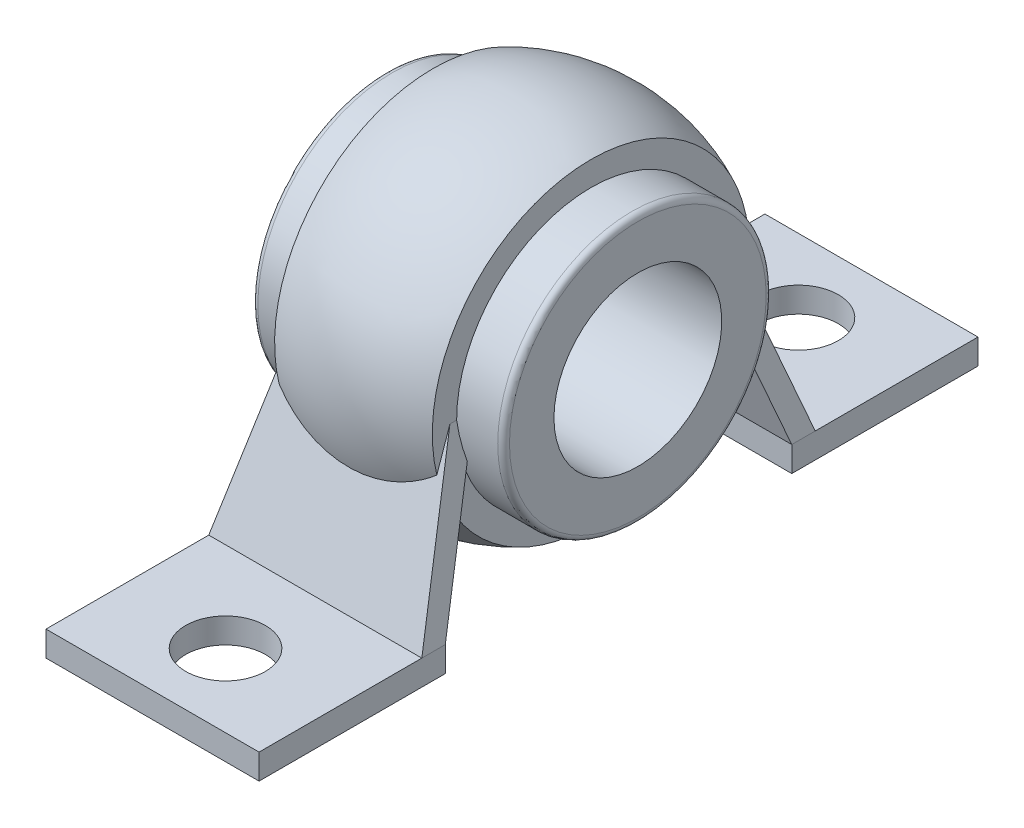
ISO-10303-21;
HEADER;
FILE_DESCRIPTION(('STEP AP214'),'2;1');
FILE_NAME('part.step','',(''),(''),'','','');
FILE_SCHEMA(('AUTOMOTIVE_DESIGN { 1 0 10303 214 1 1 1 1 }'));
ENDSEC;
DATA;
#1=APPLICATION_CONTEXT('core data for automotive mechanical design processes');
#2=APPLICATION_PROTOCOL_DEFINITION('international standard','automotive_design',2000,#1);
#3=PRODUCT_CONTEXT('',#1,'mechanical');
#4=PRODUCT('Part','Part','',(#3));
#5=PRODUCT_RELATED_PRODUCT_CATEGORY('part','',(#4));
#6=PRODUCT_DEFINITION_FORMATION('','',#4);
#7=PRODUCT_DEFINITION_CONTEXT('part definition',#1,'design');
#8=PRODUCT_DEFINITION('design','',#6,#7);
#9=PRODUCT_DEFINITION_SHAPE('','',#8);
#10=(LENGTH_UNIT() NAMED_UNIT(*) SI_UNIT(.MILLI.,.METRE.));
#11=(NAMED_UNIT(*) PLANE_ANGLE_UNIT() SI_UNIT($,.RADIAN.));
#12=(NAMED_UNIT(*) SI_UNIT($,.STERADIAN.) SOLID_ANGLE_UNIT());
#13=UNCERTAINTY_MEASURE_WITH_UNIT(LENGTH_MEASURE(1.E-05),#10,'distance_accuracy_value','');
#14=(GEOMETRIC_REPRESENTATION_CONTEXT(3) GLOBAL_UNCERTAINTY_ASSIGNED_CONTEXT((#13)) GLOBAL_UNIT_ASSIGNED_CONTEXT((#10,
#11,#12)) REPRESENTATION_CONTEXT('',''));
#15=CARTESIAN_POINT('',(0.,0.,0.));
#16=DIRECTION('',(0.,0.,1.));
#17=DIRECTION('',(1.,0.,0.));
#18=AXIS2_PLACEMENT_3D('',#15,#16,#17);
#19=CARTESIAN_POINT('',(12.7,-22.2,20.65));
#20=DIRECTION('',(0.,-1.,0.));
#21=DIRECTION('',(0.,0.,1.));
#22=AXIS2_PLACEMENT_3D('',#19,#20,#21);
#23=PLANE('',#22);
#24=CARTESIAN_POINT('',(0.,-22.2,34.15));
#25=DIRECTION('',(0.,-1.,0.));
#26=DIRECTION('',(0.,0.,-1.));
#27=AXIS2_PLACEMENT_3D('',#24,#25,#26);
#28=CIRCLE('',#27,4.75);
#29=CARTESIAN_POINT('',(0.,-22.2,29.4));
#30=VERTEX_POINT('',#29);
#31=EDGE_CURVE('E21',#30,#30,#28,.T.);
#32=ORIENTED_EDGE('',*,*,#31,.F.);
#33=EDGE_LOOP('',(#32));
#34=FACE_BOUND('',#33,.T.);
#35=DIRECTION('',(0.,0.,-1.));
#36=VECTOR('',#35,1.);
#37=CARTESIAN_POINT('',(12.7,-22.2,31.7498268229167));
#38=LINE('',#37,#36);
#39=CARTESIAN_POINT('',(12.7,-22.2,42.85));
#40=VERTEX_POINT('',#39);
#41=CARTESIAN_POINT('',(12.7,-22.2,20.65));
#42=VERTEX_POINT('',#41);
#43=EDGE_CURVE('E715',#40,#42,#38,.T.);
#44=ORIENTED_EDGE('',*,*,#43,.F.);
#45=DIRECTION('',(-1.,0.,0.));
#46=VECTOR('',#45,1.);
#47=CARTESIAN_POINT('',(12.7,-22.2,42.85));
#48=LINE('',#47,#46);
#49=CARTESIAN_POINT('',(-12.7,-22.2,42.85));
#50=VERTEX_POINT('',#49);
#51=EDGE_CURVE('E804',#50,#40,#48,.F.);
#52=ORIENTED_EDGE('',*,*,#51,.F.);
#53=DIRECTION('',(0.,0.,1.));
#54=VECTOR('',#53,1.);
#55=CARTESIAN_POINT('',(-12.7,-22.2,31.7498268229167));
#56=LINE('',#55,#54);
#57=CARTESIAN_POINT('',(-12.7,-22.2,20.65));
#58=VERTEX_POINT('',#57);
#59=EDGE_CURVE('E705',#58,#50,#56,.T.);
#60=ORIENTED_EDGE('',*,*,#59,.F.);
#61=DIRECTION('',(-1.,0.,0.));
#62=VECTOR('',#61,1.);
#63=CARTESIAN_POINT('',(12.7,-22.2,20.65));
#64=LINE('',#63,#62);
#65=EDGE_CURVE('E800',#42,#58,#64,.T.);
#66=ORIENTED_EDGE('',*,*,#65,.F.);
#67=EDGE_LOOP('',(#44,#52,#60,#66));
#68=FACE_BOUND('',#67,.T.);
#69=ADVANCED_FACE('F17',(#34,#68),#23,.T.);
#70=CARTESIAN_POINT('',(15.,0.,0.));
#71=DIRECTION('',(-1.,0.,0.));
#72=DIRECTION('',(0.,0.,1.));
#73=AXIS2_PLACEMENT_3D('',#70,#71,#72);
#74=CYLINDRICAL_SURFACE('',#73,10.);
#75=CARTESIAN_POINT('',(-15.,0.,0.));
#76=DIRECTION('',(-1.,0.,0.));
#77=DIRECTION('',(0.,0.,1.));
#78=AXIS2_PLACEMENT_3D('',#75,#76,#77);
#79=CIRCLE('',#78,10.);
#80=CARTESIAN_POINT('',(-15.,0.,10.));
#81=VERTEX_POINT('',#80);
#82=EDGE_CURVE('E702',#81,#81,#79,.F.);
#83=ORIENTED_EDGE('',*,*,#82,.F.);
#84=EDGE_LOOP('',(#83));
#85=FACE_BOUND('',#84,.T.);
#86=CARTESIAN_POINT('',(15.,0.,0.));
#87=DIRECTION('',(-1.,0.,0.));
#88=DIRECTION('',(0.,0.,1.));
#89=AXIS2_PLACEMENT_3D('',#86,#87,#88);
#90=CIRCLE('',#89,10.);
#91=CARTESIAN_POINT('',(15.,0.,10.));
#92=VERTEX_POINT('',#91);
#93=EDGE_CURVE('E697',#92,#92,#90,.T.);
#94=ORIENTED_EDGE('',*,*,#93,.F.);
#95=EDGE_LOOP('',(#94));
#96=FACE_BOUND('',#95,.T.);
#97=ADVANCED_FACE('F1028',(#85,#96),#74,.F.);
#98=CARTESIAN_POINT('',(12.7,-19.2,20.65));
#99=DIRECTION('',(0.,0.,-1.));
#100=DIRECTION('',(0.,-1.,0.));
#101=AXIS2_PLACEMENT_3D('',#98,#99,#100);
#102=PLANE('',#101);
#103=DIRECTION('',(0.,1.,0.));
#104=VECTOR('',#103,1.);
#105=CARTESIAN_POINT('',(12.7,-22.2,20.65));
#106=LINE('',#105,#104);
#107=CARTESIAN_POINT('',(12.7,-19.1995,20.6498268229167));
#108=VERTEX_POINT('',#107);
#109=EDGE_CURVE('E706',#42,#108,#106,.T.);
#110=ORIENTED_EDGE('',*,*,#109,.F.);
#111=ORIENTED_EDGE('',*,*,#65,.T.);
#112=DIRECTION('',(0.,1.,0.));
#113=VECTOR('',#112,1.);
#114=CARTESIAN_POINT('',(-12.7,-22.2,20.65));
#115=LINE('',#114,#113);
#116=CARTESIAN_POINT('',(-12.7,-19.1995,20.6498268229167));
#117=VERTEX_POINT('',#116);
#118=EDGE_CURVE('E701',#117,#58,#115,.F.);
#119=ORIENTED_EDGE('',*,*,#118,.F.);
#120=DIRECTION('',(-1.,0.,0.));
#121=VECTOR('',#120,1.);
#122=CARTESIAN_POINT('',(12.7,-19.2,20.65));
#123=LINE('',#122,#121);
#124=EDGE_CURVE('E754',#108,#117,#123,.T.);
#125=ORIENTED_EDGE('',*,*,#124,.F.);
#126=EDGE_LOOP('',(#110,#111,#119,#125));
#127=FACE_BOUND('',#126,.T.);
#128=ADVANCED_FACE('F870',(#127),#102,.T.);
#129=CARTESIAN_POINT('',(12.7,-22.2,42.85));
#130=DIRECTION('',(0.,0.,1.));
#131=DIRECTION('',(0.,1.,0.));
#132=AXIS2_PLACEMENT_3D('',#129,#130,#131);
#133=PLANE('',#132);
#134=DIRECTION('',(0.,1.,0.));
#135=VECTOR('',#134,1.);
#136=CARTESIAN_POINT('',(12.7,-22.2,42.85));
#137=LINE('',#136,#135);
#138=CARTESIAN_POINT('',(12.7,-19.2,42.85));
#139=VERTEX_POINT('',#138);
#140=EDGE_CURVE('E722',#139,#40,#137,.F.);
#141=ORIENTED_EDGE('',*,*,#140,.F.);
#142=DIRECTION('',(-1.,0.,0.));
#143=VECTOR('',#142,1.);
#144=CARTESIAN_POINT('',(12.7,-19.2,42.85));
#145=LINE('',#144,#143);
#146=CARTESIAN_POINT('',(-12.7,-19.2,42.85));
#147=VERTEX_POINT('',#146);
#148=EDGE_CURVE('E790',#147,#139,#145,.F.);
#149=ORIENTED_EDGE('',*,*,#148,.F.);
#150=DIRECTION('',(0.,1.,0.));
#151=VECTOR('',#150,1.);
#152=CARTESIAN_POINT('',(-12.7,-22.2,42.85));
#153=LINE('',#152,#151);
#154=EDGE_CURVE('E712',#50,#147,#153,.T.);
#155=ORIENTED_EDGE('',*,*,#154,.F.);
#156=ORIENTED_EDGE('',*,*,#51,.T.);
#157=EDGE_LOOP('',(#141,#149,#155,#156));
#158=FACE_BOUND('',#157,.T.);
#159=ADVANCED_FACE('F865',(#158),#133,.T.);
#160=CARTESIAN_POINT('',(0.,-19.2,34.15));
#161=DIRECTION('',(0.,-1.,0.));
#162=DIRECTION('',(0.,0.,-1.));
#163=AXIS2_PLACEMENT_3D('',#160,#161,#162);
#164=CYLINDRICAL_SURFACE('',#163,4.75);
#165=ORIENTED_EDGE('',*,*,#31,.T.);
#166=EDGE_LOOP('',(#165));
#167=FACE_BOUND('',#166,.T.);
#168=CARTESIAN_POINT('',(0.,-19.2,34.15));
#169=DIRECTION('',(0.,-1.,0.));
#170=DIRECTION('',(0.,0.,-1.));
#171=AXIS2_PLACEMENT_3D('',#168,#169,#170);
#172=CIRCLE('',#171,4.75);
#173=CARTESIAN_POINT('',(0.,-19.2,29.4));
#174=VERTEX_POINT('',#173);
#175=EDGE_CURVE('E691',#174,#174,#172,.T.);
#176=ORIENTED_EDGE('',*,*,#175,.F.);
#177=EDGE_LOOP('',(#176));
#178=FACE_BOUND('',#177,.T.);
#179=ADVANCED_FACE('F995',(#167,#178),#164,.F.);
#180=CARTESIAN_POINT('',(12.7,-22.2,42.85));
#181=DIRECTION('',(1.,0.,0.));
#182=DIRECTION('',(0.,0.,-1.));
#183=AXIS2_PLACEMENT_3D('',#180,#181,#182);
#184=PLANE('',#183);
#185=ORIENTED_EDGE('',*,*,#109,.T.);
#186=DIRECTION('',(0.,0.,-1.));
#187=VECTOR('',#186,1.);
#188=CARTESIAN_POINT('',(12.7,-19.199,23.4496536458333));
#189=LINE('',#188,#187);
#190=CARTESIAN_POINT('',(12.7,-19.1995,23.4498268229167));
#191=VERTEX_POINT('',#190);
#192=EDGE_CURVE('E688',#191,#108,#189,.T.);
#193=ORIENTED_EDGE('',*,*,#192,.F.);
#194=DIRECTION('',(0.,0.,-1.));
#195=VECTOR('',#194,1.);
#196=CARTESIAN_POINT('',(12.7,-19.2,33.15));
#197=LINE('',#196,#195);
#198=EDGE_CURVE('E696',#139,#191,#197,.T.);
#199=ORIENTED_EDGE('',*,*,#198,.F.);
#200=ORIENTED_EDGE('',*,*,#140,.T.);
#201=ORIENTED_EDGE('',*,*,#43,.T.);
#202=EDGE_LOOP('',(#185,#193,#199,#200,#201));
#203=FACE_BOUND('',#202,.T.);
#204=ADVANCED_FACE('F741',(#203),#184,.T.);
#205=CARTESIAN_POINT('',(-15.,-15.606,15.3));
#206=CARTESIAN_POINT('',(-15.,-15.3,15.3));
#207=CARTESIAN_POINT('',(-15.,15.3,15.3));
#208=B_SPLINE_CURVE_WITH_KNOTS('',1,(#205,#206,#207),.UNSPECIFIED.,.F.,.F.,(2,1,2),(-0.01,0.,
1.),.UNSPECIFIED.);
#209=DIRECTION('',(0.,0.,-1.));
#210=VECTOR('',#209,1.);
#211=SURFACE_OF_LINEAR_EXTRUSION('',#208,#210);
#212=ORIENTED_EDGE('',*,*,#82,.T.);
#213=EDGE_LOOP('',(#212));
#214=FACE_BOUND('',#213,.T.);
#215=CARTESIAN_POINT('',(-15.,0.,0.));
#216=DIRECTION('',(-1.,0.,0.));
#217=DIRECTION('',(0.,0.,1.));
#218=AXIS2_PLACEMENT_3D('',#215,#216,#217);
#219=CIRCLE('',#218,15.3);
#220=CARTESIAN_POINT('',(-15.,0.,15.3));
#221=VERTEX_POINT('',#220);
#222=EDGE_CURVE('E557',#221,#221,#219,.F.);
#223=ORIENTED_EDGE('',*,*,#222,.F.);
#224=EDGE_LOOP('',(#223));
#225=FACE_BOUND('',#224,.T.);
#226=ADVANCED_FACE('F736',(#214,#225),#211,.T.);
#227=CARTESIAN_POINT('',(-12.7,-22.2,20.6496536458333));
#228=DIRECTION('',(-1.,0.,0.));
#229=DIRECTION('',(0.,0.,1.));
#230=AXIS2_PLACEMENT_3D('',#227,#228,#229);
#231=PLANE('',#230);
#232=DIRECTION('',(0.,0.,-1.));
#233=VECTOR('',#232,1.);
#234=CARTESIAN_POINT('',(-12.7,-19.199,23.4496536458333));
#235=LINE('',#234,#233);
#236=CARTESIAN_POINT('',(-12.7,-19.1995,23.4498268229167));
#237=VERTEX_POINT('',#236);
#238=EDGE_CURVE('E550',#117,#237,#235,.F.);
#239=ORIENTED_EDGE('',*,*,#238,.F.);
#240=ORIENTED_EDGE('',*,*,#118,.T.);
#241=ORIENTED_EDGE('',*,*,#59,.T.);
#242=ORIENTED_EDGE('',*,*,#154,.T.);
#243=DIRECTION('',(0.,0.,1.));
#244=VECTOR('',#243,1.);
#245=CARTESIAN_POINT('',(-12.7,-19.2,33.15));
#246=LINE('',#245,#244);
#247=EDGE_CURVE('E782',#237,#147,#246,.T.);
#248=ORIENTED_EDGE('',*,*,#247,.F.);
#249=EDGE_LOOP('',(#239,#240,#241,#242,#248));
#250=FACE_BOUND('',#249,.T.);
#251=ADVANCED_FACE('F740',(#250),#231,.T.);
#252=CARTESIAN_POINT('',(15.,15.3,15.3));
#253=CARTESIAN_POINT('',(15.,-15.3,15.3));
#254=CARTESIAN_POINT('',(15.,-15.606,15.3));
#255=B_SPLINE_CURVE_WITH_KNOTS('',1,(#252,#253,#254),.UNSPECIFIED.,.F.,.F.,(2,1,2),(0.,1.,1.01),.UNSPECIFIED.);
#256=DIRECTION('',(0.,0.,-1.));
#257=VECTOR('',#256,1.);
#258=SURFACE_OF_LINEAR_EXTRUSION('',#255,#257);
#259=ORIENTED_EDGE('',*,*,#93,.T.);
#260=EDGE_LOOP('',(#259));
#261=FACE_BOUND('',#260,.T.);
#262=CARTESIAN_POINT('',(15.,0.,0.));
#263=DIRECTION('',(-1.,0.,0.));
#264=DIRECTION('',(0.,0.,1.));
#265=AXIS2_PLACEMENT_3D('',#262,#263,#264);
#266=CIRCLE('',#265,15.3);
#267=CARTESIAN_POINT('',(15.,0.,15.3));
#268=VERTEX_POINT('',#267);
#269=EDGE_CURVE('E209',#268,#268,#266,.T.);
#270=ORIENTED_EDGE('',*,*,#269,.F.);
#271=EDGE_LOOP('',(#270));
#272=FACE_BOUND('',#271,.T.);
#273=ADVANCED_FACE('F744',(#261,#272),#258,.T.);
#274=CARTESIAN_POINT('',(12.8524,-4.17445267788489,15.4458390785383));
#275=DIRECTION('',(0.,-0.327279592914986,-0.944927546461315));
#276=DIRECTION('',(0.,-0.944927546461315,0.327279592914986));
#277=AXIS2_PLACEMENT_3D('',#274,#275,#276);
#278=PLANE('',#277);
#279=CARTESIAN_POINT('',(9.4,-8.42533271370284,16.918149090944));
#280=CARTESIAN_POINT('',(9.19926056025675,-8.5502344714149,16.9614093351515));
#281=CARTESIAN_POINT('',(8.99573462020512,-8.67108565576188,17.0032666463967));
#282=CARTESIAN_POINT('',(8.58344055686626,-8.90451647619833,17.0841163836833));
#283=CARTESIAN_POINT('',(8.37467248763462,-9.01709619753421,17.1231088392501));
#284=CARTESIAN_POINT('',(7.74112675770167,-9.34210871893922,17.2356782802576));
#285=CARTESIAN_POINT('',(7.3089819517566,-9.541892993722,17.3048743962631));
#286=CARTESIAN_POINT('',(6.42887999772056,-9.9060660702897,17.4310072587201));
#287=CARTESIAN_POINT('',(5.98093887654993,-10.0704896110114,17.4879560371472));
#288=CARTESIAN_POINT('',(5.07198864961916,-10.3631387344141,17.589316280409));
#289=CARTESIAN_POINT('',(4.6109795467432,-10.491364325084,17.6337277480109));
#290=CARTESIAN_POINT('',(3.67911968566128,-10.7107752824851,17.7097216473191));
#291=CARTESIAN_POINT('',(3.20826734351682,-10.8019546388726,17.7413019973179));
#292=CARTESIAN_POINT('',(2.26011258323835,-10.9466441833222,17.7914158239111));
#293=CARTESIAN_POINT('',(1.78281001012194,-11.0001534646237,17.8099489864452));
#294=CARTESIAN_POINT('',(0.825061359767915,-11.0691505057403,17.8338463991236));
#295=CARTESIAN_POINT('',(0.344614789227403,-11.0846321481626,17.8392085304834));
#296=CARTESIAN_POINT('',(-0.615950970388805,-11.0774525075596,17.8367218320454));
#297=CARTESIAN_POINT('',(-1.09607016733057,-11.054792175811,17.8288733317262));
#298=CARTESIAN_POINT('',(-2.05461403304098,-10.9713094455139,17.7999587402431));
#299=CARTESIAN_POINT('',(-2.53302292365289,-10.9103258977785,17.7788368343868));
#300=CARTESIAN_POINT('',(-3.48274323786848,-10.7504372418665,17.723458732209));
#301=CARTESIAN_POINT('',(-3.95405483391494,-10.6515330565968,17.68920285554));
#302=CARTESIAN_POINT('',(-4.65285486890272,-10.4753218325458,17.6281713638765));
#303=CARTESIAN_POINT('',(-4.88437284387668,-10.4119606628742,17.6062259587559));
#304=CARTESIAN_POINT('',(-5.34431187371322,-10.2760713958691,17.5591601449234));
#305=CARTESIAN_POINT('',(-5.57273368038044,-10.2035455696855,17.5340405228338));
#306=CARTESIAN_POINT('',(-6.25268535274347,-9.97241218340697,17.4539865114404));
#307=CARTESIAN_POINT('',(-6.69913372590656,-9.80019013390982,17.3943366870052));
#308=CARTESIAN_POINT('',(-7.52974931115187,-9.44024890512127,17.2696695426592));
#309=CARTESIAN_POINT('',(-7.91559205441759,-9.2559582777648,17.2058397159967));
#310=CARTESIAN_POINT('',(-8.6706139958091,-8.86054066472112,17.0688851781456));
#311=CARTESIAN_POINT('',(-9.03982291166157,-8.64946433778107,16.9957780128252));
#312=CARTESIAN_POINT('',(-9.4,-8.42533271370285,16.918149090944));
#313=B_SPLINE_CURVE_WITH_KNOTS('',3,(#279,#280,#281,#282,#283,#284,#285,#286,#287,#288,#289,
#290,#291,#292,#293,#294,#295,#296,#297,#298,#299,#300,#301,#302,#303,#304,#305,#306,#307,#308,
#309,#310,#311,#312),.UNSPECIFIED.,.F.,.F.,(4,2,2,2,2,2,2,2,2,2,2,2,2,2,2,2,4),(0.,
0.720936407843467,1.44186538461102,2.88327365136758,4.32325932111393,5.76324467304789,
7.20346355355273,8.64371710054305,10.0842023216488,11.5246516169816,12.9711989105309,
14.4177110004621,15.140622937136,15.86335607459,17.3081034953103,18.6038933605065,
19.8972680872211),.UNSPECIFIED.);
#314=CARTESIAN_POINT('',(9.40000000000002,-8.42533271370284,16.918149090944));
#315=VERTEX_POINT('',#314);
#316=CARTESIAN_POINT('',(-9.40000000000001,-8.42533271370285,16.918149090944));
#317=VERTEX_POINT('',#316);
#318=EDGE_CURVE('E166',#315,#317,#313,.T.);
#319=ORIENTED_EDGE('',*,*,#318,.F.);
#320=CARTESIAN_POINT('',(9.40000000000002,-4.17445267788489,15.4458390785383));
#321=CARTESIAN_POINT('',(9.40000000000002,-4.3515726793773,15.5071853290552));
#322=CARTESIAN_POINT('',(9.40000000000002,-4.52869268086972,15.5685315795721));
#323=CARTESIAN_POINT('',(9.40000000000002,-4.88293268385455,15.6912240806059));
#324=CARTESIAN_POINT('',(9.40000000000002,-5.06005268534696,15.7525703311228));
#325=CARTESIAN_POINT('',(9.40000000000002,-5.41429268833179,15.8752628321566));
#326=CARTESIAN_POINT('',(9.40000000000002,-5.59141268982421,15.9366090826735));
#327=CARTESIAN_POINT('',(9.40000000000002,-5.94565269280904,16.0593015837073));
#328=CARTESIAN_POINT('',(9.40000000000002,-6.12277269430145,16.1206478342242));
#329=CARTESIAN_POINT('',(9.40000000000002,-6.47701269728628,16.243340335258));
#330=CARTESIAN_POINT('',(9.40000000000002,-6.6541326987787,16.3046865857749));
#331=CARTESIAN_POINT('',(9.40000000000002,-7.00837270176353,16.4273790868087));
#332=CARTESIAN_POINT('',(9.40000000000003,-7.18549270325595,16.4887253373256));
#333=CARTESIAN_POINT('',(9.40000000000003,-7.53973270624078,16.6114178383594));
#334=CARTESIAN_POINT('',(9.40000000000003,-7.71685270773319,16.6727640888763));
#335=CARTESIAN_POINT('',(9.40000000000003,-8.07109271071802,16.7954565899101));
#336=CARTESIAN_POINT('',(9.40000000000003,-8.24821271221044,16.8568028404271));
#337=CARTESIAN_POINT('',(9.40000000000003,-8.42533271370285,16.918149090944));
#338=B_SPLINE_CURVE_WITH_KNOTS('',3,(#320,#321,#322,#323,#324,#325,#326,#327,#328,#329,#330,
#331,#332,#333,#334,#335,#336,#337),.UNSPECIFIED.,.F.,.F.,(4,2,2,2,2,2,2,2,4),(0.,
0.562328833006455,1.12465766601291,1.68698649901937,2.24931533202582,2.81164416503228,
3.37397299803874,3.93630183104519,4.49863066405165),.UNSPECIFIED.);
#339=CARTESIAN_POINT('',(9.40000000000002,-4.17445267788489,15.4458390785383));
#340=VERTEX_POINT('',#339);
#341=EDGE_CURVE('E186',#340,#315,#338,.T.);
#342=ORIENTED_EDGE('',*,*,#341,.F.);
#343=DIRECTION('',(-1.,0.,0.));
#344=VECTOR('',#343,1.);
#345=CARTESIAN_POINT('',(12.7,-4.17445267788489,15.4458390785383));
#346=LINE('',#345,#344);
#347=CARTESIAN_POINT('',(10.1167388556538,-4.17445267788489,15.4458390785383));
#348=VERTEX_POINT('',#347);
#349=EDGE_CURVE('E700',#340,#348,#346,.F.);
#350=ORIENTED_EDGE('',*,*,#349,.T.);
#351=CARTESIAN_POINT('',(12.7,-19.199,20.6496536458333));
#352=CARTESIAN_POINT('',(12.5923641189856,-18.5729771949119,20.4328280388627));
#353=CARTESIAN_POINT('',(12.4847282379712,-17.9469543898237,20.2160024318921));
#354=CARTESIAN_POINT('',(12.2694564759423,-16.6949087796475,19.7823512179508));
#355=CARTESIAN_POINT('',(12.1618205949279,-16.0688859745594,19.5655256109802));
#356=CARTESIAN_POINT('',(11.946548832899,-14.8168403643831,19.1318743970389));
#357=CARTESIAN_POINT('',(11.8389129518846,-14.190817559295,18.9150487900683));
#358=CARTESIAN_POINT('',(11.6236411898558,-12.9387719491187,18.481397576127));
#359=CARTESIAN_POINT('',(11.5160053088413,-12.3127491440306,18.2645719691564));
#360=CARTESIAN_POINT('',(11.3007335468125,-11.0607035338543,17.8309207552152));
#361=CARTESIAN_POINT('',(11.1930976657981,-10.4346807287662,17.6140951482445));
#362=CARTESIAN_POINT('',(10.9778259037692,-9.18263511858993,17.1804439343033));
#363=CARTESIAN_POINT('',(10.8701900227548,-8.5566123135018,16.9636183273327));
#364=CARTESIAN_POINT('',(10.654918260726,-7.30456670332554,16.5299671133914));
#365=CARTESIAN_POINT('',(10.5472823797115,-6.67854389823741,16.3131415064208));
#366=CARTESIAN_POINT('',(10.3320106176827,-5.42649828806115,15.8794902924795));
#367=CARTESIAN_POINT('',(10.2243747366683,-4.80047548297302,15.6626646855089));
#368=CARTESIAN_POINT('',(10.1167388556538,-4.17445267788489,15.4458390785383));
#369=B_SPLINE_CURVE_WITH_KNOTS('',3,(#351,#352,#353,#354,#355,#356,#357,#358,#359,#360,#361,
#362,#363,#364,#365,#366,#367,#368),.UNSPECIFIED.,.F.,.F.,(4,2,2,2,2,2,2,2,4),(0.,
2.01358645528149,4.02717291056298,6.04075936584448,8.05434582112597,10.0679322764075,
12.081518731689,14.0951051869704,16.1086916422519),.UNSPECIFIED.);
#370=EDGE_CURVE('E685',#108,#348,#369,.T.);
#371=ORIENTED_EDGE('',*,*,#370,.F.);
#372=ORIENTED_EDGE('',*,*,#124,.T.);
#373=CARTESIAN_POINT('',(-10.1167388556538,-4.1744526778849,15.4458390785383));
#374=CARTESIAN_POINT('',(-10.2243747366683,-4.80047548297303,15.6626646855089));
#375=CARTESIAN_POINT('',(-10.3320106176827,-5.42649828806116,15.8794902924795));
#376=CARTESIAN_POINT('',(-10.5472823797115,-6.67854389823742,16.3131415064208));
#377=CARTESIAN_POINT('',(-10.654918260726,-7.30456670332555,16.5299671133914));
#378=CARTESIAN_POINT('',(-10.8701900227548,-8.55661231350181,16.9636183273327));
#379=CARTESIAN_POINT('',(-10.9778259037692,-9.18263511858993,17.1804439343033));
#380=CARTESIAN_POINT('',(-11.1930976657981,-10.4346807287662,17.6140951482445));
#381=CARTESIAN_POINT('',(-11.3007335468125,-11.0607035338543,17.8309207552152));
#382=CARTESIAN_POINT('',(-11.5160053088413,-12.3127491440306,18.2645719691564));
#383=CARTESIAN_POINT('',(-11.6236411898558,-12.9387719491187,18.4813975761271));
#384=CARTESIAN_POINT('',(-11.8389129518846,-14.190817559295,18.9150487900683));
#385=CARTESIAN_POINT('',(-11.946548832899,-14.8168403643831,19.1318743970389));
#386=CARTESIAN_POINT('',(-12.1618205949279,-16.0688859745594,19.5655256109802));
#387=CARTESIAN_POINT('',(-12.2694564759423,-16.6949087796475,19.7823512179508));
#388=CARTESIAN_POINT('',(-12.4847282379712,-17.9469543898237,20.2160024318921));
#389=CARTESIAN_POINT('',(-12.5923641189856,-18.5729771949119,20.4328280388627));
#390=CARTESIAN_POINT('',(-12.7,-19.199,20.6496536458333));
#391=B_SPLINE_CURVE_WITH_KNOTS('',3,(#373,#374,#375,#376,#377,#378,#379,#380,#381,#382,#383,
#384,#385,#386,#387,#388,#389,#390),.UNSPECIFIED.,.F.,.F.,(4,2,2,2,2,2,2,2,4),(0.,
2.01358645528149,4.02717291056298,6.04075936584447,8.05434582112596,10.0679322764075,
12.0815187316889,14.0951051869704,16.1086916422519),.UNSPECIFIED.);
#392=CARTESIAN_POINT('',(-10.1167388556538,-4.17445267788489,15.4458390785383));
#393=VERTEX_POINT('',#392);
#394=EDGE_CURVE('E553',#393,#117,#391,.T.);
#395=ORIENTED_EDGE('',*,*,#394,.F.);
#396=DIRECTION('',(-1.,0.,0.));
#397=VECTOR('',#396,1.);
#398=CARTESIAN_POINT('',(12.7,-4.17445267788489,15.4458390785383));
#399=LINE('',#398,#397);
#400=CARTESIAN_POINT('',(-9.40000000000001,-4.17445267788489,15.4458390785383));
#401=VERTEX_POINT('',#400);
#402=EDGE_CURVE('E172',#393,#401,#399,.F.);
#403=ORIENTED_EDGE('',*,*,#402,.T.);
#404=CARTESIAN_POINT('',(-9.40000000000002,-8.42533271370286,16.918149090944));
#405=CARTESIAN_POINT('',(-9.40000000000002,-8.24821271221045,16.8568028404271));
#406=CARTESIAN_POINT('',(-9.40000000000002,-8.07109271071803,16.7954565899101));
#407=CARTESIAN_POINT('',(-9.40000000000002,-7.7168527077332,16.6727640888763));
#408=CARTESIAN_POINT('',(-9.40000000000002,-7.53973270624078,16.6114178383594));
#409=CARTESIAN_POINT('',(-9.40000000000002,-7.18549270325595,16.4887253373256));
#410=CARTESIAN_POINT('',(-9.40000000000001,-7.00837270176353,16.4273790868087));
#411=CARTESIAN_POINT('',(-9.40000000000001,-6.6541326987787,16.3046865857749));
#412=CARTESIAN_POINT('',(-9.40000000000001,-6.47701269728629,16.243340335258));
#413=CARTESIAN_POINT('',(-9.40000000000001,-6.12277269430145,16.1206478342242));
#414=CARTESIAN_POINT('',(-9.40000000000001,-5.94565269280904,16.0593015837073));
#415=CARTESIAN_POINT('',(-9.40000000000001,-5.59141268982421,15.9366090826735));
#416=CARTESIAN_POINT('',(-9.40000000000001,-5.41429268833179,15.8752628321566));
#417=CARTESIAN_POINT('',(-9.40000000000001,-5.06005268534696,15.7525703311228));
#418=CARTESIAN_POINT('',(-9.40000000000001,-4.88293268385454,15.6912240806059));
#419=CARTESIAN_POINT('',(-9.40000000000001,-4.52869268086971,15.5685315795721));
#420=CARTESIAN_POINT('',(-9.40000000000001,-4.3515726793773,15.5071853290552));
#421=CARTESIAN_POINT('',(-9.40000000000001,-4.17445267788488,15.4458390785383));
#422=B_SPLINE_CURVE_WITH_KNOTS('',3,(#404,#405,#406,#407,#408,#409,#410,#411,#412,#413,#414,
#415,#416,#417,#418,#419,#420,#421),.UNSPECIFIED.,.F.,.F.,(4,2,2,2,2,2,2,2,4),(0.,
0.562328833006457,1.12465766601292,1.68698649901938,2.24931533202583,2.81164416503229,
3.37397299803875,3.93630183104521,4.49863066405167),.UNSPECIFIED.);
#423=EDGE_CURVE('E169',#317,#401,#422,.T.);
#424=ORIENTED_EDGE('',*,*,#423,.F.);
#425=EDGE_LOOP('',(#319,#342,#350,#371,#372,#395,#403,#424));
#426=FACE_BOUND('',#425,.T.);
#427=ADVANCED_FACE('F170',(#426),#278,.T.);
#428=CARTESIAN_POINT('',(12.7,-19.2,42.85));
#429=DIRECTION('',(0.,1.,0.));
#430=DIRECTION('',(0.,0.,-1.));
#431=AXIS2_PLACEMENT_3D('',#428,#429,#430);
#432=PLANE('',#431);
#433=ORIENTED_EDGE('',*,*,#175,.T.);
#434=EDGE_LOOP('',(#433));
#435=FACE_BOUND('',#434,.T.);
#436=ORIENTED_EDGE('',*,*,#198,.T.);
#437=DIRECTION('',(-1.,0.,0.));
#438=VECTOR('',#437,1.);
#439=CARTESIAN_POINT('',(12.7,-19.2,23.45));
#440=LINE('',#439,#438);
#441=EDGE_CURVE('E275',#237,#191,#440,.F.);
#442=ORIENTED_EDGE('',*,*,#441,.F.);
#443=ORIENTED_EDGE('',*,*,#247,.T.);
#444=ORIENTED_EDGE('',*,*,#148,.T.);
#445=EDGE_LOOP('',(#436,#442,#443,#444));
#446=FACE_BOUND('',#445,.T.);
#447=ADVANCED_FACE('F679',(#435,#446),#432,.T.);
#448=CARTESIAN_POINT('',(9.4,-0.00581611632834,23.4976765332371));
#449=DIRECTION('',(0.98553884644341,0.169449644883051,0.));
#450=DIRECTION('',(0.169449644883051,-0.98553884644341,0.));
#451=AXIS2_PLACEMENT_3D('',#448,#449,#450);
#452=PLANE('',#451);
#453=ORIENTED_EDGE('',*,*,#192,.T.);
#454=ORIENTED_EDGE('',*,*,#370,.T.);
#455=CARTESIAN_POINT('',(9.39900000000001,0.,0.));
#456=DIRECTION('',(0.98553884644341,0.169449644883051,0.));
#457=DIRECTION('',(-0.169449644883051,0.98553884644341,0.));
#458=AXIS2_PLACEMENT_3D('',#455,#456,#457);
#459=ELLIPSE('',#458,16.2347735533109,16.);
#460=CARTESIAN_POINT('',(9.4,-0.00581611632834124,15.9999989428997));
#461=VERTEX_POINT('',#460);
#462=EDGE_CURVE('E193',#461,#348,#459,.T.);
#463=ORIENTED_EDGE('',*,*,#462,.F.);
#464=DIRECTION('',(0.,0.,-1.));
#465=VECTOR('',#464,1.);
#466=CARTESIAN_POINT('',(9.4,-0.00581611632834,23.4496536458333));
#467=LINE('',#466,#465);
#468=CARTESIAN_POINT('',(9.40000000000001,-0.00581611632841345,16.8020144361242));
#469=VERTEX_POINT('',#468);
#470=EDGE_CURVE('E695',#461,#469,#467,.F.);
#471=ORIENTED_EDGE('',*,*,#470,.T.);
#472=CARTESIAN_POINT('',(12.7,-19.199,23.4496536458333));
#473=CARTESIAN_POINT('',(12.5625,-18.399284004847,23.1726686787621));
#474=CARTESIAN_POINT('',(12.425,-17.599568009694,22.8956837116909));
#475=CARTESIAN_POINT('',(12.15,-16.0001360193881,22.3417137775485));
#476=CARTESIAN_POINT('',(12.0125,-15.2004200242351,22.0647288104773));
#477=CARTESIAN_POINT('',(11.7375,-13.6009880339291,21.5107588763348));
#478=CARTESIAN_POINT('',(11.6,-12.8012720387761,21.2337739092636));
#479=CARTESIAN_POINT('',(11.325,-11.2018400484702,20.6798039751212));
#480=CARTESIAN_POINT('',(11.1875,-10.4021240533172,20.40281900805));
#481=CARTESIAN_POINT('',(10.9125,-8.80269206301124,19.8488490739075));
#482=CARTESIAN_POINT('',(10.775,-8.00297606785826,19.5718641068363));
#483=CARTESIAN_POINT('',(10.5,-6.40354407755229,19.0178941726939));
#484=CARTESIAN_POINT('',(10.3625,-5.60382808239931,18.7409092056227));
#485=CARTESIAN_POINT('',(10.0875,-4.00439609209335,18.1869392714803));
#486=CARTESIAN_POINT('',(9.95000000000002,-3.20468009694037,17.909954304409));
#487=CARTESIAN_POINT('',(9.67500000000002,-1.6052481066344,17.3559843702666));
#488=CARTESIAN_POINT('',(9.53750000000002,-0.80553211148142,17.0789994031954));
#489=CARTESIAN_POINT('',(9.40000000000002,-0.00581611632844,16.8020144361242));
#490=B_SPLINE_CURVE_WITH_KNOTS('',3,(#472,#473,#474,#475,#476,#477,#478,#479,#480,#481,#482,
#483,#484,#485,#486,#487,#488,#489),.UNSPECIFIED.,.F.,.F.,(4,2,2,2,2,2,2,2,4),(0.,
2.5722661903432,5.14453238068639,7.71679857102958,10.2890647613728,12.861330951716,
15.4335971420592,18.0058633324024,20.5781295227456),.UNSPECIFIED.);
#491=EDGE_CURVE('E265',#191,#469,#490,.T.);
#492=ORIENTED_EDGE('',*,*,#491,.F.);
#493=EDGE_LOOP('',(#453,#454,#463,#471,#492));
#494=FACE_BOUND('',#493,.T.);
#495=ADVANCED_FACE('F673',(#494),#452,.T.);
#496=CARTESIAN_POINT('',(-14.3,0.,0.));
#497=DIRECTION('',(-1.,0.,0.));
#498=DIRECTION('',(0.,0.,1.));
#499=AXIS2_PLACEMENT_3D('',#496,#497,#498);
#500=TOROIDAL_SURFACE('',#499,15.3,0.7);
#501=ORIENTED_EDGE('',*,*,#222,.T.);
#502=EDGE_LOOP('',(#501));
#503=FACE_BOUND('',#502,.T.);
#504=CARTESIAN_POINT('',(-14.3,0.,0.));
#505=DIRECTION('',(-1.,0.,0.));
#506=DIRECTION('',(0.,1.,0.));
#507=AXIS2_PLACEMENT_3D('',#504,#505,#506);
#508=CIRCLE('',#507,16.);
#509=CARTESIAN_POINT('',(-14.3,16.,0.));
#510=VERTEX_POINT('',#509);
#511=EDGE_CURVE('E562',#510,#510,#508,.F.);
#512=ORIENTED_EDGE('',*,*,#511,.F.);
#513=EDGE_LOOP('',(#512));
#514=FACE_BOUND('',#513,.T.);
#515=ADVANCED_FACE('F573',(#503,#514),#500,.T.);
#516=CARTESIAN_POINT('',(-12.7,-19.199,23.4976765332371));
#517=DIRECTION('',(-0.98553884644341,0.169449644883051,0.));
#518=DIRECTION('',(0.169449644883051,0.98553884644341,0.));
#519=AXIS2_PLACEMENT_3D('',#516,#517,#518);
#520=PLANE('',#519);
#521=CARTESIAN_POINT('',(-9.40000000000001,-0.00581611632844,16.8020144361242));
#522=CARTESIAN_POINT('',(-9.53750000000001,-0.805532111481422,17.0789994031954));
#523=CARTESIAN_POINT('',(-9.67500000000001,-1.6052481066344,17.3559843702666));
#524=CARTESIAN_POINT('',(-9.95000000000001,-3.20468009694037,17.909954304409));
#525=CARTESIAN_POINT('',(-10.0875,-4.00439609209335,18.1869392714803));
#526=CARTESIAN_POINT('',(-10.3625,-5.60382808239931,18.7409092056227));
#527=CARTESIAN_POINT('',(-10.5,-6.40354407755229,19.0178941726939));
#528=CARTESIAN_POINT('',(-10.775,-8.00297606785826,19.5718641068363));
#529=CARTESIAN_POINT('',(-10.9125,-8.80269206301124,19.8488490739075));
#530=CARTESIAN_POINT('',(-11.1875,-10.4021240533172,20.40281900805));
#531=CARTESIAN_POINT('',(-11.325,-11.2018400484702,20.6798039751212));
#532=CARTESIAN_POINT('',(-11.6,-12.8012720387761,21.2337739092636));
#533=CARTESIAN_POINT('',(-11.7375,-13.6009880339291,21.5107588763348));
#534=CARTESIAN_POINT('',(-12.0125,-15.2004200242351,22.0647288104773));
#535=CARTESIAN_POINT('',(-12.15,-16.0001360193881,22.3417137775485));
#536=CARTESIAN_POINT('',(-12.425,-17.599568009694,22.8956837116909));
#537=CARTESIAN_POINT('',(-12.5625,-18.399284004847,23.1726686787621));
#538=CARTESIAN_POINT('',(-12.7,-19.199,23.4496536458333));
#539=B_SPLINE_CURVE_WITH_KNOTS('',3,(#521,#522,#523,#524,#525,#526,#527,#528,#529,#530,#531,
#532,#533,#534,#535,#536,#537,#538),.UNSPECIFIED.,.F.,.F.,(4,2,2,2,2,2,2,2,4),(0.,
2.57226619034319,5.14453238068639,7.71679857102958,10.2890647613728,12.861330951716,
15.4335971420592,18.0058633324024,20.5781295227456),.UNSPECIFIED.);
#540=CARTESIAN_POINT('',(-9.40000000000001,-0.00581611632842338,16.8020144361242));
#541=VERTEX_POINT('',#540);
#542=EDGE_CURVE('E198',#541,#237,#539,.T.);
#543=ORIENTED_EDGE('',*,*,#542,.F.);
#544=DIRECTION('',(0.,0.,-1.));
#545=VECTOR('',#544,1.);
#546=CARTESIAN_POINT('',(-9.4,-0.00581611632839,23.4496536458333));
#547=LINE('',#546,#545);
#548=CARTESIAN_POINT('',(-9.4,-0.00581611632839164,15.9999989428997));
#549=VERTEX_POINT('',#548);
#550=EDGE_CURVE('E547',#541,#549,#547,.T.);
#551=ORIENTED_EDGE('',*,*,#550,.T.);
#552=CARTESIAN_POINT('',(-9.399,0.,0.));
#553=DIRECTION('',(-0.98553884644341,0.169449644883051,0.));
#554=DIRECTION('',(-0.169449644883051,-0.98553884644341,0.));
#555=AXIS2_PLACEMENT_3D('',#552,#553,#554);
#556=ELLIPSE('',#555,16.2347735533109,16.);
#557=EDGE_CURVE('E546',#393,#549,#556,.T.);
#558=ORIENTED_EDGE('',*,*,#557,.F.);
#559=ORIENTED_EDGE('',*,*,#394,.T.);
#560=ORIENTED_EDGE('',*,*,#238,.T.);
#561=EDGE_LOOP('',(#543,#551,#558,#559,#560));
#562=FACE_BOUND('',#561,.T.);
#563=ADVANCED_FACE('F576',(#562),#520,.T.);
#564=CARTESIAN_POINT('',(14.3,0.,0.));
#565=DIRECTION('',(-1.,0.,0.));
#566=DIRECTION('',(0.,0.,1.));
#567=AXIS2_PLACEMENT_3D('',#564,#565,#566);
#568=TOROIDAL_SURFACE('',#567,15.3,0.7);
#569=CARTESIAN_POINT('',(14.3,0.,0.));
#570=DIRECTION('',(-1.,0.,0.));
#571=DIRECTION('',(0.,1.,0.));
#572=AXIS2_PLACEMENT_3D('',#569,#570,#571);
#573=CIRCLE('',#572,16.);
#574=CARTESIAN_POINT('',(14.3,16.,0.));
#575=VERTEX_POINT('',#574);
#576=EDGE_CURVE('E542',#575,#575,#573,.T.);
#577=ORIENTED_EDGE('',*,*,#576,.F.);
#578=EDGE_LOOP('',(#577));
#579=FACE_BOUND('',#578,.T.);
#580=ORIENTED_EDGE('',*,*,#269,.T.);
#581=EDGE_LOOP('',(#580));
#582=FACE_BOUND('',#581,.T.);
#583=ADVANCED_FACE('F588',(#579,#582),#568,.T.);
#584=CARTESIAN_POINT('',(9.40000000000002,-4.17445267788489,16.918149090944));
#585=CARTESIAN_POINT('',(9.40000000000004,-18.9,16.918149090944));
#586=CARTESIAN_POINT('',(9.40000000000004,-19.0472554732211,16.918149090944));
#587=CARTESIAN_POINT('',(9.40000000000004,-19.2534668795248,16.918149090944));
#588=B_SPLINE_CURVE_WITH_KNOTS('',1,(#584,#585,#586,#587),.UNSPECIFIED.,.F.,.F.,(2,1,1,2),(0.,
1.,1.01,1.02400364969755),.UNSPECIFIED.);
#589=DIRECTION('',(0.,0.,-1.));
#590=VECTOR('',#589,1.);
#591=SURFACE_OF_LINEAR_EXTRUSION('',#588,#590);
#592=CARTESIAN_POINT('',(9.4,0.,0.));
#593=DIRECTION('',(-1.,0.,0.));
#594=DIRECTION('',(0.,0.,1.));
#595=AXIS2_PLACEMENT_3D('',#592,#593,#594);
#596=CIRCLE('',#595,16.);
#597=CARTESIAN_POINT('',(9.40000000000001,-4.17445267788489,-15.4458390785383));
#598=VERTEX_POINT('',#597);
#599=EDGE_CURVE('E530',#340,#598,#596,.F.);
#600=ORIENTED_EDGE('',*,*,#599,.F.);
#601=ORIENTED_EDGE('',*,*,#341,.T.);
#602=CARTESIAN_POINT('',(9.4,0.,0.));
#603=DIRECTION('',(-1.,0.,0.));
#604=DIRECTION('',(0.,0.,1.));
#605=AXIS2_PLACEMENT_3D('',#602,#603,#604);
#606=CIRCLE('',#605,18.9);
#607=CARTESIAN_POINT('',(9.4,-8.42533271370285,-16.918149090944));
#608=VERTEX_POINT('',#607);
#609=EDGE_CURVE('E178',#608,#315,#606,.T.);
#610=ORIENTED_EDGE('',*,*,#609,.F.);
#611=DIRECTION('',(0.,-0.944927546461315,-0.327279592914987));
#612=VECTOR('',#611,1.);
#613=CARTESIAN_POINT('',(9.40000000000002,-11.6872263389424,-18.0479195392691));
#614=LINE('',#613,#612);
#615=EDGE_CURVE('E529',#598,#608,#614,.T.);
#616=ORIENTED_EDGE('',*,*,#615,.F.);
#617=EDGE_LOOP('',(#600,#601,#610,#616));
#618=FACE_BOUND('',#617,.T.);
#619=ADVANCED_FACE('F219',(#618),#591,.T.);
#620=CARTESIAN_POINT('',(0.,0.,-1.0880952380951));
#621=DIRECTION('',(0.,1.,0.));
#622=DIRECTION('',(-0.998785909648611,0.,0.0492616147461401));
#623=AXIS2_PLACEMENT_3D('',#620,#621,#622);
#624=CIRCLE('',#623,22.0880952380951);
#625=TRIMMED_CURVE('',#624,(PARAMETER_VALUE(0.)),(PARAMETER_VALUE(3.04302953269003)),.T.,.PARAMETER.);
#626=CARTESIAN_POINT('',(0.,0.,0.));
#627=DIRECTION('',(-1.,0.,0.));
#628=AXIS1_PLACEMENT('',#626,#627);
#629=SURFACE_OF_REVOLUTION('',#625,#628);
#630=CARTESIAN_POINT('',(9.4,-8.42533271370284,-16.918149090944));
#631=CARTESIAN_POINT('',(9.19926056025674,-8.5502344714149,-16.9614093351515));
#632=CARTESIAN_POINT('',(8.99573462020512,-8.67108565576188,-17.0032666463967));
#633=CARTESIAN_POINT('',(8.58344055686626,-8.90451647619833,-17.0841163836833));
#634=CARTESIAN_POINT('',(8.37467248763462,-9.01709619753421,-17.1231088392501));
#635=CARTESIAN_POINT('',(7.74112675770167,-9.34210871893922,-17.2356782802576));
#636=CARTESIAN_POINT('',(7.3089819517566,-9.541892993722,-17.3048743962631));
#637=CARTESIAN_POINT('',(6.42887999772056,-9.90606607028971,-17.4310072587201));
#638=CARTESIAN_POINT('',(5.98093887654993,-10.0704896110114,-17.4879560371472));
#639=CARTESIAN_POINT('',(5.07198864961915,-10.3631387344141,-17.589316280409));
#640=CARTESIAN_POINT('',(4.6109795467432,-10.491364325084,-17.6337277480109));
#641=CARTESIAN_POINT('',(3.67911968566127,-10.7107752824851,-17.7097216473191));
#642=CARTESIAN_POINT('',(3.20826734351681,-10.8019546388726,-17.7413019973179));
#643=CARTESIAN_POINT('',(2.26011258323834,-10.9466441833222,-17.7914158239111));
#644=CARTESIAN_POINT('',(1.78281001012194,-11.0001534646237,-17.8099489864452));
#645=CARTESIAN_POINT('',(0.82506135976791,-11.0691505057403,-17.8338463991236));
#646=CARTESIAN_POINT('',(0.344614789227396,-11.0846321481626,-17.8392085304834));
#647=CARTESIAN_POINT('',(-0.615950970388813,-11.0774525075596,-17.8367218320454));
#648=CARTESIAN_POINT('',(-1.09607016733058,-11.054792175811,-17.8288733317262));
#649=CARTESIAN_POINT('',(-2.05461403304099,-10.9713094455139,-17.7999587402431));
#650=CARTESIAN_POINT('',(-2.53302292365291,-10.9103258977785,-17.7788368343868));
#651=CARTESIAN_POINT('',(-3.48274323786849,-10.7504372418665,-17.723458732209));
#652=CARTESIAN_POINT('',(-3.95405483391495,-10.6515330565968,-17.68920285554));
#653=CARTESIAN_POINT('',(-4.65285486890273,-10.4753218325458,-17.6281713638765));
#654=CARTESIAN_POINT('',(-4.88437284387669,-10.4119606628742,-17.6062259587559));
#655=CARTESIAN_POINT('',(-5.34431187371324,-10.2760713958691,-17.5591601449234));
#656=CARTESIAN_POINT('',(-5.57273368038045,-10.2035455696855,-17.5340405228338));
#657=CARTESIAN_POINT('',(-6.25268535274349,-9.97241218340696,-17.4539865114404));
#658=CARTESIAN_POINT('',(-6.69913372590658,-9.80019013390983,-17.3943366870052));
#659=CARTESIAN_POINT('',(-7.52974931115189,-9.44024890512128,-17.2696695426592));
#660=CARTESIAN_POINT('',(-7.9155920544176,-9.2559582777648,-17.2058397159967));
#661=CARTESIAN_POINT('',(-8.67061399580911,-8.86054066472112,-17.0688851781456));
#662=CARTESIAN_POINT('',(-9.03982291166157,-8.64946433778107,-16.9957780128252));
#663=CARTESIAN_POINT('',(-9.4,-8.42533271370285,-16.918149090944));
#664=B_SPLINE_CURVE_WITH_KNOTS('',3,(#630,#631,#632,#633,#634,#635,#636,#637,#638,#639,#640,
#641,#642,#643,#644,#645,#646,#647,#648,#649,#650,#651,#652,#653,#654,#655,#656,#657,#658,#659,
#660,#661,#662,#663),.UNSPECIFIED.,.F.,.F.,(4,2,2,2,2,2,2,2,2,2,2,2,2,2,2,2,4),(0.,
0.720936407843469,1.44186538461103,2.88327365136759,4.32325932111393,5.7632446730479,
7.20346355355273,8.64371710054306,10.0842023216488,11.5246516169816,12.9711989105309,
14.4177110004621,15.140622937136,15.86335607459,17.3081034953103,18.6038933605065,
19.8972680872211),.UNSPECIFIED.);
#665=CARTESIAN_POINT('',(-9.40000000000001,-8.42533271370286,-16.918149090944));
#666=VERTEX_POINT('',#665);
#667=EDGE_CURVE('E538',#608,#666,#664,.T.);
#668=ORIENTED_EDGE('',*,*,#667,.F.);
#669=ORIENTED_EDGE('',*,*,#609,.T.);
#670=ORIENTED_EDGE('',*,*,#318,.T.);
#671=CARTESIAN_POINT('',(-9.4,0.,0.));
#672=DIRECTION('',(-1.,0.,0.));
#673=DIRECTION('',(0.,0.,1.));
#674=AXIS2_PLACEMENT_3D('',#671,#672,#673);
#675=CIRCLE('',#674,18.9);
#676=EDGE_CURVE('E177',#666,#317,#675,.T.);
#677=ORIENTED_EDGE('',*,*,#676,.F.);
#678=EDGE_LOOP('',(#668,#669,#670,#677));
#679=FACE_BOUND('',#678,.T.);
#680=ADVANCED_FACE('F183',(#679),#629,.F.);
#681=CARTESIAN_POINT('',(-9.40000000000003,-19.2534668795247,16.918149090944));
#682=CARTESIAN_POINT('',(-9.40000000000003,-19.0472554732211,16.918149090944));
#683=CARTESIAN_POINT('',(-9.40000000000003,-18.9,16.918149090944));
#684=CARTESIAN_POINT('',(-9.40000000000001,-4.17445267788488,16.918149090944));
#685=B_SPLINE_CURVE_WITH_KNOTS('',1,(#681,#682,#683,#684),.UNSPECIFIED.,.F.,.F.,(2,1,1,2),
(-0.0240036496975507,-0.01,0.,1.),.UNSPECIFIED.);
#686=DIRECTION('',(0.,0.,-1.));
#687=VECTOR('',#686,1.);
#688=SURFACE_OF_LINEAR_EXTRUSION('',#685,#687);
#689=DIRECTION('',(0.,0.944927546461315,0.327279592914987));
#690=VECTOR('',#689,1.);
#691=CARTESIAN_POINT('',(-9.40000000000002,-11.6872263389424,-18.0479195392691));
#692=LINE('',#691,#690);
#693=CARTESIAN_POINT('',(-9.40000000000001,-4.17445267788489,-15.4458390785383));
#694=VERTEX_POINT('',#693);
#695=EDGE_CURVE('E190',#666,#694,#692,.T.);
#696=ORIENTED_EDGE('',*,*,#695,.F.);
#697=ORIENTED_EDGE('',*,*,#676,.T.);
#698=ORIENTED_EDGE('',*,*,#423,.T.);
#699=CARTESIAN_POINT('',(-9.4,0.,0.));
#700=DIRECTION('',(-1.,0.,0.));
#701=DIRECTION('',(0.,0.,1.));
#702=AXIS2_PLACEMENT_3D('',#699,#700,#701);
#703=CIRCLE('',#702,16.);
#704=EDGE_CURVE('E659',#694,#401,#703,.T.);
#705=ORIENTED_EDGE('',*,*,#704,.F.);
#706=EDGE_LOOP('',(#696,#697,#698,#705));
#707=FACE_BOUND('',#706,.T.);
#708=ADVANCED_FACE('F188',(#707),#688,.T.);
#709=CARTESIAN_POINT('',(12.8524,-19.2,23.45));
#710=DIRECTION('',(0.,0.327279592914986,0.944927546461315));
#711=DIRECTION('',(0.,0.944927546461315,-0.327279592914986));
#712=AXIS2_PLACEMENT_3D('',#709,#710,#711);
#713=PLANE('',#712);
#714=ORIENTED_EDGE('',*,*,#441,.T.);
#715=ORIENTED_EDGE('',*,*,#491,.T.);
#716=CARTESIAN_POINT('',(9.40000000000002,-4.49640933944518,18.3573501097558));
#717=CARTESIAN_POINT('',(9.40000000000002,-4.30930128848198,18.2925444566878));
#718=CARTESIAN_POINT('',(9.40000000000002,-4.12219323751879,18.2277388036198));
#719=CARTESIAN_POINT('',(9.40000000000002,-3.74797713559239,18.0981274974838));
#720=CARTESIAN_POINT('',(9.40000000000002,-3.5608690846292,18.0333218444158));
#721=CARTESIAN_POINT('',(9.40000000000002,-3.18665298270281,17.9037105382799));
#722=CARTESIAN_POINT('',(9.40000000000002,-2.99954493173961,17.8389048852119));
#723=CARTESIAN_POINT('',(9.40000000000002,-2.62532882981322,17.7092935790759));
#724=CARTESIAN_POINT('',(9.40000000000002,-2.43822077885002,17.644487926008));
#725=CARTESIAN_POINT('',(9.40000000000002,-2.06400467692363,17.514876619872));
#726=CARTESIAN_POINT('',(9.40000000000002,-1.87689662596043,17.450070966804));
#727=CARTESIAN_POINT('',(9.40000000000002,-1.50268052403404,17.320459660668));
#728=CARTESIAN_POINT('',(9.40000000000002,-1.31557247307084,17.2556540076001));
#729=CARTESIAN_POINT('',(9.40000000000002,-0.941356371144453,17.1260427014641));
#730=CARTESIAN_POINT('',(9.40000000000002,-0.754248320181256,17.0612370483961));
#731=CARTESIAN_POINT('',(9.40000000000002,-0.380032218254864,16.9316257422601));
#732=CARTESIAN_POINT('',(9.40000000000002,-0.192924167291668,16.8668200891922));
#733=CARTESIAN_POINT('',(9.40000000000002,-0.00581611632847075,16.8020144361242));
#734=B_SPLINE_CURVE_WITH_KNOTS('',3,(#716,#717,#718,#719,#720,#721,#722,#723,#724,#725,#726,
#727,#728,#729,#730,#731,#732,#733),.UNSPECIFIED.,.F.,.F.,(4,2,2,2,2,2,2,2,4),(0.,
0.594039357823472,1.18807871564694,1.78211807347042,2.37615743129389,2.97019678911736,
3.56423614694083,4.1582755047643,4.75231486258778),.UNSPECIFIED.);
#735=CARTESIAN_POINT('',(9.40000000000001,-4.49640933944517,18.3573501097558));
#736=VERTEX_POINT('',#735);
#737=EDGE_CURVE('E314',#736,#469,#734,.T.);
#738=ORIENTED_EDGE('',*,*,#737,.F.);
#739=CARTESIAN_POINT('',(-9.4,-4.49640933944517,18.3573501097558));
#740=CARTESIAN_POINT('',(-9.09515898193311,-4.74607777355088,18.4438238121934));
#741=CARTESIAN_POINT('',(-8.77895477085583,-4.9833217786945,18.5259942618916));
#742=CARTESIAN_POINT('',(-8.12637109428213,-5.43149896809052,18.6812222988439));
#743=CARTESIAN_POINT('',(-7.78999431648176,-5.64243564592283,18.7542810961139));
#744=CARTESIAN_POINT('',(-7.09989414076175,-6.03639790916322,18.8907315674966));
#745=CARTESIAN_POINT('',(-6.74618919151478,-6.21945236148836,18.9541332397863));
#746=CARTESIAN_POINT('',(-6.02370566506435,-6.556734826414,19.0709524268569));
#747=CARTESIAN_POINT('',(-5.65492689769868,-6.71096247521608,19.1243698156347));
#748=CARTESIAN_POINT('',(-4.90493135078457,-6.98960018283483,19.2208771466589));
#749=CARTESIAN_POINT('',(-4.52371358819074,-7.11400787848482,19.2639662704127));
#750=CARTESIAN_POINT('',(-3.75158367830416,-7.33219239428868,19.3395353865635));
#751=CARTESIAN_POINT('',(-3.3606714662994,-7.42596900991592,19.3720153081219));
#752=CARTESIAN_POINT('',(-2.57197269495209,-7.58227904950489,19.4261539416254));
#753=CARTESIAN_POINT('',(-2.17418713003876,-7.64481695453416,19.4478142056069));
#754=CARTESIAN_POINT('',(-1.37447895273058,-7.73827119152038,19.4801824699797));
#755=CARTESIAN_POINT('',(-0.972556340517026,-7.76918752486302,19.490890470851));
#756=CARTESIAN_POINT('',(-0.164881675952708,-7.79929482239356,19.5013182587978));
#757=CARTESIAN_POINT('',(0.240878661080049,-7.79828768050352,19.5009694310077));
#758=CARTESIAN_POINT('',(1.05088074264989,-7.76406451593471,19.4891160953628));
#759=CARTESIAN_POINT('',(1.45512246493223,-7.73084802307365,19.4776114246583));
#760=CARTESIAN_POINT('',(2.25946086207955,-7.63239022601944,19.4435101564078));
#761=CARTESIAN_POINT('',(2.65955491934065,-7.56712982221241,19.4209069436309));
#762=CARTESIAN_POINT('',(3.45249094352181,-7.40500001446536,19.3647526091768));
#763=CARTESIAN_POINT('',(3.84533317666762,-7.3081317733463,19.3312018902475));
#764=CARTESIAN_POINT('',(4.6218853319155,-7.08314802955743,19.253277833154));
#765=CARTESIAN_POINT('',(5.00557143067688,-6.95495909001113,19.2088790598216));
#766=CARTESIAN_POINT('',(5.76005393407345,-6.6682911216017,19.1095904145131));
#767=CARTESIAN_POINT('',(6.13085057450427,-6.50981264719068,19.0547007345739));
#768=CARTESIAN_POINT('',(6.85617718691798,-6.16392433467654,18.9349008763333));
#769=CARTESIAN_POINT('',(7.21073459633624,-5.97656582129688,18.8700084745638));
#770=CARTESIAN_POINT('',(7.90148789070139,-5.57402681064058,18.7305874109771));
#771=CARTESIAN_POINT('',(8.23769447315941,-5.35886277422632,18.6560644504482));
#772=CARTESIAN_POINT('',(8.70714177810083,-5.0298297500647,18.5421024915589));
#773=CARTESIAN_POINT('',(8.84880838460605,-4.92655045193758,18.5063312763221));
#774=CARTESIAN_POINT('',(9.12771481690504,-4.71512540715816,18.4331033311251));
#775=CARTESIAN_POINT('',(9.26496010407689,-4.60698609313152,18.3956488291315));
#776=CARTESIAN_POINT('',(9.4,-4.49640933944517,18.3573501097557));
#777=B_SPLINE_CURVE_WITH_KNOTS('',3,(#739,#740,#741,#742,#743,#744,#745,#746,#747,#748,#749,
#750,#751,#752,#753,#754,#755,#756,#757,#758,#759,#760,#761,#762,#763,#764,#765,#766,#767,#768,
#769,#770,#771,#772,#773,#774,#775,#776),.UNSPECIFIED.,.F.,.F.,(4,2,2,2,2,2,2,2,2,2,2,2,2,2,2,2,
2,2,4),(0.,1.20982556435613,2.41949029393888,3.62789399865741,4.83631295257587,6.04482763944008,
7.25335039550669,8.46169974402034,9.67004903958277,10.8858983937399,12.1017654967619,
13.3183581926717,14.5349061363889,15.7543343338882,16.9737402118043,18.1910034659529,
19.4075493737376,19.9442300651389,20.4802202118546),.UNSPECIFIED.);
#778=CARTESIAN_POINT('',(-9.40000000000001,-4.49640933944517,18.3573501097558));
#779=VERTEX_POINT('',#778);
#780=EDGE_CURVE('E274',#779,#736,#777,.T.);
#781=ORIENTED_EDGE('',*,*,#780,.F.);
#782=CARTESIAN_POINT('',(-9.40000000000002,-0.00581611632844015,16.8020144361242));
#783=CARTESIAN_POINT('',(-9.40000000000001,-0.192924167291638,16.8668200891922));
#784=CARTESIAN_POINT('',(-9.40000000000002,-0.380032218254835,16.9316257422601));
#785=CARTESIAN_POINT('',(-9.40000000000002,-0.75424832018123,17.0612370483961));
#786=CARTESIAN_POINT('',(-9.40000000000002,-0.941356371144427,17.1260427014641));
#787=CARTESIAN_POINT('',(-9.40000000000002,-1.31557247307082,17.2556540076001));
#788=CARTESIAN_POINT('',(-9.40000000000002,-1.50268052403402,17.320459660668));
#789=CARTESIAN_POINT('',(-9.40000000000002,-1.87689662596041,17.450070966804));
#790=CARTESIAN_POINT('',(-9.40000000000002,-2.06400467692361,17.514876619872));
#791=CARTESIAN_POINT('',(-9.40000000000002,-2.43822077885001,17.644487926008));
#792=CARTESIAN_POINT('',(-9.40000000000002,-2.62532882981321,17.7092935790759));
#793=CARTESIAN_POINT('',(-9.40000000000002,-2.9995449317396,17.8389048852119));
#794=CARTESIAN_POINT('',(-9.40000000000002,-3.1866529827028,17.9037105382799));
#795=CARTESIAN_POINT('',(-9.40000000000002,-3.56086908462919,18.0333218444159));
#796=CARTESIAN_POINT('',(-9.40000000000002,-3.74797713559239,18.0981274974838));
#797=CARTESIAN_POINT('',(-9.40000000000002,-4.12219323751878,18.2277388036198));
#798=CARTESIAN_POINT('',(-9.40000000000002,-4.30930128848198,18.2925444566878));
#799=CARTESIAN_POINT('',(-9.40000000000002,-4.49640933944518,18.3573501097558));
#800=B_SPLINE_CURVE_WITH_KNOTS('',3,(#782,#783,#784,#785,#786,#787,#788,#789,#790,#791,#792,
#793,#794,#795,#796,#797,#798,#799),.UNSPECIFIED.,.F.,.F.,(4,2,2,2,2,2,2,2,4),(0.,
0.594039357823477,1.18807871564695,1.78211807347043,2.37615743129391,2.97019678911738,
3.56423614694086,4.15827550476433,4.75231486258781),.UNSPECIFIED.);
#801=EDGE_CURVE('E349',#541,#779,#800,.T.);
#802=ORIENTED_EDGE('',*,*,#801,.F.);
#803=ORIENTED_EDGE('',*,*,#542,.T.);
#804=EDGE_LOOP('',(#714,#715,#738,#781,#802,#803));
#805=FACE_BOUND('',#804,.T.);
#806=ADVANCED_FACE('F258',(#805),#713,.T.);
#807=CARTESIAN_POINT('',(-14.3,0.,0.));
#808=DIRECTION('',(-1.,0.,0.));
#809=DIRECTION('',(0.,0.,1.));
#810=AXIS2_PLACEMENT_3D('',#807,#808,#809);
#811=CYLINDRICAL_SURFACE('',#810,16.);
#812=ORIENTED_EDGE('',*,*,#511,.T.);
#813=EDGE_LOOP('',(#812));
#814=FACE_BOUND('',#813,.T.);
#815=ORIENTED_EDGE('',*,*,#557,.T.);
#816=CARTESIAN_POINT('',(-9.4,0.,0.));
#817=DIRECTION('',(-1.,0.,0.));
#818=DIRECTION('',(0.,0.,1.));
#819=AXIS2_PLACEMENT_3D('',#816,#817,#818);
#820=CIRCLE('',#819,16.);
#821=CARTESIAN_POINT('',(-9.40000000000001,-0.00581611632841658,-15.9999989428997));
#822=VERTEX_POINT('',#821);
#823=EDGE_CURVE('E635',#822,#549,#820,.F.);
#824=ORIENTED_EDGE('',*,*,#823,.F.);
#825=CARTESIAN_POINT('',(-9.399,0.,0.));
#826=DIRECTION('',(-0.98553884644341,0.169449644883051,0.));
#827=DIRECTION('',(-0.169449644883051,-0.98553884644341,0.));
#828=AXIS2_PLACEMENT_3D('',#825,#826,#827);
#829=ELLIPSE('',#828,16.2347735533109,16.);
#830=CARTESIAN_POINT('',(-10.1167388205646,-4.17445247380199,-15.4458391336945));
#831=VERTEX_POINT('',#830);
#832=EDGE_CURVE('E516',#831,#822,#829,.F.);
#833=ORIENTED_EDGE('',*,*,#832,.F.);
#834=DIRECTION('',(-1.,0.,0.));
#835=VECTOR('',#834,1.);
#836=CARTESIAN_POINT('',(12.7,-4.1744526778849,-15.4458390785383));
#837=LINE('',#836,#835);
#838=EDGE_CURVE('E531',#694,#831,#837,.T.);
#839=ORIENTED_EDGE('',*,*,#838,.F.);
#840=ORIENTED_EDGE('',*,*,#704,.T.);
#841=ORIENTED_EDGE('',*,*,#402,.F.);
#842=EDGE_LOOP('',(#815,#824,#833,#839,#840,#841));
#843=FACE_BOUND('',#842,.T.);
#844=ADVANCED_FACE('F669',(#814,#843),#811,.T.);
#845=CARTESIAN_POINT('',(9.4,0.,0.));
#846=DIRECTION('',(-1.,0.,0.));
#847=DIRECTION('',(0.,0.,1.));
#848=AXIS2_PLACEMENT_3D('',#845,#846,#847);
#849=CYLINDRICAL_SURFACE('',#848,16.);
#850=ORIENTED_EDGE('',*,*,#576,.T.);
#851=EDGE_LOOP('',(#850));
#852=FACE_BOUND('',#851,.T.);
#853=CARTESIAN_POINT('',(9.39900000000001,0.,0.));
#854=DIRECTION('',(0.98553884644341,0.169449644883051,0.));
#855=DIRECTION('',(-0.169449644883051,0.98553884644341,0.));
#856=AXIS2_PLACEMENT_3D('',#853,#854,#855);
#857=ELLIPSE('',#856,16.2347735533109,16.);
#858=CARTESIAN_POINT('',(9.4,-0.00581611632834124,-15.9999989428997));
#859=VERTEX_POINT('',#858);
#860=CARTESIAN_POINT('',(10.1167388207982,-4.1744526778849,-15.4458390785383));
#861=VERTEX_POINT('',#860);
#862=EDGE_CURVE('E489',#859,#861,#857,.F.);
#863=ORIENTED_EDGE('',*,*,#862,.F.);
#864=CARTESIAN_POINT('',(9.4,0.,0.));
#865=DIRECTION('',(-1.,0.,0.));
#866=DIRECTION('',(0.,0.,1.));
#867=AXIS2_PLACEMENT_3D('',#864,#865,#866);
#868=CIRCLE('',#867,16.);
#869=EDGE_CURVE('E535',#461,#859,#868,.T.);
#870=ORIENTED_EDGE('',*,*,#869,.F.);
#871=ORIENTED_EDGE('',*,*,#462,.T.);
#872=ORIENTED_EDGE('',*,*,#349,.F.);
#873=ORIENTED_EDGE('',*,*,#599,.T.);
#874=DIRECTION('',(-1.,0.,0.));
#875=VECTOR('',#874,1.);
#876=CARTESIAN_POINT('',(12.7,-4.1744526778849,-15.4458390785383));
#877=LINE('',#876,#875);
#878=EDGE_CURVE('E520',#861,#598,#877,.T.);
#879=ORIENTED_EDGE('',*,*,#878,.F.);
#880=EDGE_LOOP('',(#863,#870,#871,#872,#873,#879));
#881=FACE_BOUND('',#880,.T.);
#882=ADVANCED_FACE('F822',(#852,#881),#849,.T.);
#883=CARTESIAN_POINT('',(12.8524,-19.2,-20.65));
#884=DIRECTION('',(0.,-0.327279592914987,0.944927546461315));
#885=DIRECTION('',(0.,0.944927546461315,0.327279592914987));
#886=AXIS2_PLACEMENT_3D('',#883,#884,#885);
#887=PLANE('',#886);
#888=DIRECTION('',(-1.,0.,0.));
#889=VECTOR('',#888,1.);
#890=CARTESIAN_POINT('',(12.7,-19.2,-20.65));
#891=LINE('',#890,#889);
#892=CARTESIAN_POINT('',(12.7,-19.1995,-20.6498268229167));
#893=VERTEX_POINT('',#892);
#894=CARTESIAN_POINT('',(-12.7,-19.1995,-20.6498268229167));
#895=VERTEX_POINT('',#894);
#896=EDGE_CURVE('E369',#893,#895,#891,.T.);
#897=ORIENTED_EDGE('',*,*,#896,.F.);
#898=CARTESIAN_POINT('',(10.1167388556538,-4.1744526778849,-15.4458390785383));
#899=CARTESIAN_POINT('',(10.2243747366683,-4.80047548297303,-15.6626646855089));
#900=CARTESIAN_POINT('',(10.3320106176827,-5.42649828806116,-15.8794902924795));
#901=CARTESIAN_POINT('',(10.5472823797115,-6.67854389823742,-16.3131415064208));
#902=CARTESIAN_POINT('',(10.654918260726,-7.30456670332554,-16.5299671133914));
#903=CARTESIAN_POINT('',(10.8701900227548,-8.5566123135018,-16.9636183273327));
#904=CARTESIAN_POINT('',(10.9778259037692,-9.18263511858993,-17.1804439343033));
#905=CARTESIAN_POINT('',(11.1930976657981,-10.4346807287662,-17.6140951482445));
#906=CARTESIAN_POINT('',(11.3007335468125,-11.0607035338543,-17.8309207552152));
#907=CARTESIAN_POINT('',(11.5160053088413,-12.3127491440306,-18.2645719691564));
#908=CARTESIAN_POINT('',(11.6236411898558,-12.9387719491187,-18.481397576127));
#909=CARTESIAN_POINT('',(11.8389129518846,-14.190817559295,-18.9150487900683));
#910=CARTESIAN_POINT('',(11.946548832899,-14.8168403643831,-19.1318743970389));
#911=CARTESIAN_POINT('',(12.1618205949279,-16.0688859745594,-19.5655256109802));
#912=CARTESIAN_POINT('',(12.2694564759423,-16.6949087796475,-19.7823512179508));
#913=CARTESIAN_POINT('',(12.4847282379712,-17.9469543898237,-20.2160024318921));
#914=CARTESIAN_POINT('',(12.5923641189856,-18.5729771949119,-20.4328280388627));
#915=CARTESIAN_POINT('',(12.7,-19.199,-20.6496536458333));
#916=B_SPLINE_CURVE_WITH_KNOTS('',3,(#898,#899,#900,#901,#902,#903,#904,#905,#906,#907,#908,
#909,#910,#911,#912,#913,#914,#915),.UNSPECIFIED.,.F.,.F.,(4,2,2,2,2,2,2,2,4),(0.,
2.01358645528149,4.02717291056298,6.04075936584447,8.05434582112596,10.0679322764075,
12.0815187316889,14.0951051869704,16.1086916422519),.UNSPECIFIED.);
#917=EDGE_CURVE('E485',#861,#893,#916,.T.);
#918=ORIENTED_EDGE('',*,*,#917,.F.);
#919=ORIENTED_EDGE('',*,*,#878,.T.);
#920=ORIENTED_EDGE('',*,*,#615,.T.);
#921=ORIENTED_EDGE('',*,*,#667,.T.);
#922=ORIENTED_EDGE('',*,*,#695,.T.);
#923=ORIENTED_EDGE('',*,*,#838,.T.);
#924=CARTESIAN_POINT('',(-12.7,-19.199,-20.6496536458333));
#925=CARTESIAN_POINT('',(-12.5923641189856,-18.5729771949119,-20.4328280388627));
#926=CARTESIAN_POINT('',(-12.4847282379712,-17.9469543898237,-20.2160024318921));
#927=CARTESIAN_POINT('',(-12.2694564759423,-16.6949087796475,-19.7823512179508));
#928=CARTESIAN_POINT('',(-12.1618205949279,-16.0688859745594,-19.5655256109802));
#929=CARTESIAN_POINT('',(-11.946548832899,-14.8168403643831,-19.1318743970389));
#930=CARTESIAN_POINT('',(-11.8389129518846,-14.190817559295,-18.9150487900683));
#931=CARTESIAN_POINT('',(-11.6236411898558,-12.9387719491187,-18.4813975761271));
#932=CARTESIAN_POINT('',(-11.5160053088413,-12.3127491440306,-18.2645719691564));
#933=CARTESIAN_POINT('',(-11.3007335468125,-11.0607035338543,-17.8309207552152));
#934=CARTESIAN_POINT('',(-11.1930976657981,-10.4346807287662,-17.6140951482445));
#935=CARTESIAN_POINT('',(-10.9778259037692,-9.18263511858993,-17.1804439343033));
#936=CARTESIAN_POINT('',(-10.8701900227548,-8.5566123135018,-16.9636183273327));
#937=CARTESIAN_POINT('',(-10.654918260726,-7.30456670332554,-16.5299671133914));
#938=CARTESIAN_POINT('',(-10.5472823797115,-6.67854389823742,-16.3131415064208));
#939=CARTESIAN_POINT('',(-10.3320106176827,-5.42649828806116,-15.8794902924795));
#940=CARTESIAN_POINT('',(-10.2243747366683,-4.80047548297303,-15.6626646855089));
#941=CARTESIAN_POINT('',(-10.1167388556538,-4.1744526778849,-15.4458390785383));
#942=B_SPLINE_CURVE_WITH_KNOTS('',3,(#924,#925,#926,#927,#928,#929,#930,#931,#932,#933,#934,
#935,#936,#937,#938,#939,#940,#941),.UNSPECIFIED.,.F.,.F.,(4,2,2,2,2,2,2,2,4),(0.,
2.01358645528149,4.02717291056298,6.04075936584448,8.05434582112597,10.0679322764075,
12.0815187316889,14.0951051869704,16.1086916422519),.UNSPECIFIED.);
#943=EDGE_CURVE('E513',#895,#831,#942,.T.);
#944=ORIENTED_EDGE('',*,*,#943,.F.);
#945=EDGE_LOOP('',(#897,#918,#919,#920,#921,#922,#923,#944));
#946=FACE_BOUND('',#945,.T.);
#947=ADVANCED_FACE('F301',(#946),#887,.T.);
#948=CARTESIAN_POINT('',(9.4,19.1339640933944,18.9));
#949=CARTESIAN_POINT('',(9.4,18.9,18.9));
#950=CARTESIAN_POINT('',(9.40000000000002,-4.49640933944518,18.9));
#951=B_SPLINE_CURVE_WITH_KNOTS('',1,(#948,#949,#950),.UNSPECIFIED.,.F.,.F.,(2,1,2),(-0.01,0.,
1.),.UNSPECIFIED.);
#952=DIRECTION('',(0.,0.,-1.));
#953=VECTOR('',#952,1.);
#954=SURFACE_OF_LINEAR_EXTRUSION('',#951,#953);
#955=CARTESIAN_POINT('',(9.4,0.,0.));
#956=DIRECTION('',(-1.,0.,0.));
#957=DIRECTION('',(0.,0.,1.));
#958=AXIS2_PLACEMENT_3D('',#955,#956,#957);
#959=CIRCLE('',#958,18.9);
#960=CARTESIAN_POINT('',(9.40000000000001,-4.49640933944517,-18.3573501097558));
#961=VERTEX_POINT('',#960);
#962=EDGE_CURVE('E628',#736,#961,#959,.T.);
#963=ORIENTED_EDGE('',*,*,#962,.F.);
#964=ORIENTED_EDGE('',*,*,#737,.T.);
#965=ORIENTED_EDGE('',*,*,#470,.F.);
#966=ORIENTED_EDGE('',*,*,#869,.T.);
#967=DIRECTION('',(0.,0.,-1.));
#968=VECTOR('',#967,1.);
#969=CARTESIAN_POINT('',(9.4,-0.00581611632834,-15.4458390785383));
#970=LINE('',#969,#968);
#971=CARTESIAN_POINT('',(9.40000000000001,-0.00581611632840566,-16.8020144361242));
#972=VERTEX_POINT('',#971);
#973=EDGE_CURVE('E477',#972,#859,#970,.F.);
#974=ORIENTED_EDGE('',*,*,#973,.F.);
#975=DIRECTION('',(0.,0.944927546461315,0.327279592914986));
#976=VECTOR('',#975,1.);
#977=CARTESIAN_POINT('',(9.40000000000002,-9.60290805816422,-20.1260072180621));
#978=LINE('',#977,#976);
#979=EDGE_CURVE('E362',#961,#972,#978,.T.);
#980=ORIENTED_EDGE('',*,*,#979,.F.);
#981=EDGE_LOOP('',(#963,#964,#965,#966,#974,#980));
#982=FACE_BOUND('',#981,.T.);
#983=ADVANCED_FACE('F295',(#982),#954,.T.);
#984=CARTESIAN_POINT('',(-12.7,-19.199,-15.3978161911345));
#985=DIRECTION('',(-0.98553884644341,0.169449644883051,0.));
#986=DIRECTION('',(0.169449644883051,0.98553884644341,0.));
#987=AXIS2_PLACEMENT_3D('',#984,#985,#986);
#988=PLANE('',#987);
#989=DIRECTION('',(0.,0.,-1.));
#990=VECTOR('',#989,1.);
#991=CARTESIAN_POINT('',(-12.7,-19.199,-31.7498268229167));
#992=LINE('',#991,#990);
#993=CARTESIAN_POINT('',(-12.7,-19.1995,-23.4498268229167));
#994=VERTEX_POINT('',#993);
#995=EDGE_CURVE('E355',#895,#994,#992,.T.);
#996=ORIENTED_EDGE('',*,*,#995,.F.);
#997=ORIENTED_EDGE('',*,*,#943,.T.);
#998=ORIENTED_EDGE('',*,*,#832,.T.);
#999=DIRECTION('',(0.,0.,-1.));
#1000=VECTOR('',#999,1.);
#1001=CARTESIAN_POINT('',(-9.40000000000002,-0.00581611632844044,18.9));
#1002=LINE('',#1001,#1000);
#1003=CARTESIAN_POINT('',(-9.40000000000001,-0.00581611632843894,-16.8020144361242));
#1004=VERTEX_POINT('',#1003);
#1005=EDGE_CURVE('E641',#1004,#822,#1002,.F.);
#1006=ORIENTED_EDGE('',*,*,#1005,.F.);
#1007=CARTESIAN_POINT('',(-12.7,-19.199,-23.4496536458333));
#1008=CARTESIAN_POINT('',(-12.5625,-18.399284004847,-23.1726686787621));
#1009=CARTESIAN_POINT('',(-12.425,-17.599568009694,-22.8956837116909));
#1010=CARTESIAN_POINT('',(-12.15,-16.0001360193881,-22.3417137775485));
#1011=CARTESIAN_POINT('',(-12.0125,-15.2004200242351,-22.0647288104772));
#1012=CARTESIAN_POINT('',(-11.7375,-13.6009880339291,-21.5107588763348));
#1013=CARTESIAN_POINT('',(-11.6,-12.8012720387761,-21.2337739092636));
#1014=CARTESIAN_POINT('',(-11.325,-11.2018400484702,-20.6798039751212));
#1015=CARTESIAN_POINT('',(-11.1875,-10.4021240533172,-20.40281900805));
#1016=CARTESIAN_POINT('',(-10.9125,-8.80269206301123,-19.8488490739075));
#1017=CARTESIAN_POINT('',(-10.775,-8.00297606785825,-19.5718641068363));
#1018=CARTESIAN_POINT('',(-10.5,-6.40354407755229,-19.0178941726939));
#1019=CARTESIAN_POINT('',(-10.3625,-5.60382808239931,-18.7409092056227));
#1020=CARTESIAN_POINT('',(-10.0875,-4.00439609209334,-18.1869392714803));
#1021=CARTESIAN_POINT('',(-9.95000000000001,-3.20468009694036,-17.909954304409));
#1022=CARTESIAN_POINT('',(-9.67500000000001,-1.6052481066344,-17.3559843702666));
#1023=CARTESIAN_POINT('',(-9.53750000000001,-0.805532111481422,-17.0789994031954));
#1024=CARTESIAN_POINT('',(-9.40000000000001,-0.00581611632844,-16.8020144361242));
#1025=B_SPLINE_CURVE_WITH_KNOTS('',3,(#1007,#1008,#1009,#1010,#1011,#1012,#1013,#1014,#1015,
#1016,#1017,#1018,#1019,#1020,#1021,#1022,#1023,#1024),.UNSPECIFIED.,.F.,.F.,(4,2,2,2,2,2,2,2,
4),(0.,2.57226619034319,5.14453238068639,7.71679857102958,10.2890647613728,12.861330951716,
15.4335971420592,18.0058633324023,20.5781295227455),.UNSPECIFIED.);
#1026=EDGE_CURVE('E395',#994,#1004,#1025,.T.);
#1027=ORIENTED_EDGE('',*,*,#1026,.F.);
#1028=EDGE_LOOP('',(#996,#997,#998,#1006,#1027));
#1029=FACE_BOUND('',#1028,.T.);
#1030=ADVANCED_FACE('F300',(#1029),#988,.T.);
#1031=CARTESIAN_POINT('',(-9.40000000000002,-4.49640933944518,18.9));
#1032=CARTESIAN_POINT('',(-9.4,18.9,18.9));
#1033=CARTESIAN_POINT('',(-9.4,19.1339640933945,18.9));
#1034=B_SPLINE_CURVE_WITH_KNOTS('',1,(#1031,#1032,#1033),.UNSPECIFIED.,.F.,.F.,(2,1,2),(0.,1.,
1.01),.UNSPECIFIED.);
#1035=DIRECTION('',(0.,0.,-1.));
#1036=VECTOR('',#1035,1.);
#1037=SURFACE_OF_LINEAR_EXTRUSION('',#1034,#1036);
#1038=ORIENTED_EDGE('',*,*,#823,.T.);
#1039=ORIENTED_EDGE('',*,*,#550,.F.);
#1040=ORIENTED_EDGE('',*,*,#801,.T.);
#1041=CARTESIAN_POINT('',(-9.4,0.,0.));
#1042=DIRECTION('',(-1.,0.,0.));
#1043=DIRECTION('',(0.,0.,1.));
#1044=AXIS2_PLACEMENT_3D('',#1041,#1042,#1043);
#1045=CIRCLE('',#1044,18.9);
#1046=CARTESIAN_POINT('',(-9.4,-4.49640933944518,-18.3573501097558));
#1047=VERTEX_POINT('',#1046);
#1048=EDGE_CURVE('E634',#1047,#779,#1045,.F.);
#1049=ORIENTED_EDGE('',*,*,#1048,.F.);
#1050=DIRECTION('',(0.,-0.944927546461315,-0.327279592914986));
#1051=VECTOR('',#1050,1.);
#1052=CARTESIAN_POINT('',(-9.40000000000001,-9.60290805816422,-20.1260072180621));
#1053=LINE('',#1052,#1051);
#1054=EDGE_CURVE('E404',#1004,#1047,#1053,.T.);
#1055=ORIENTED_EDGE('',*,*,#1054,.F.);
#1056=ORIENTED_EDGE('',*,*,#1005,.T.);
#1057=EDGE_LOOP('',(#1038,#1039,#1040,#1049,#1055,#1056));
#1058=FACE_BOUND('',#1057,.T.);
#1059=ADVANCED_FACE('F326',(#1058),#1037,.T.);
#1060=CARTESIAN_POINT('',(0.,0.,-1.0880952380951));
#1061=DIRECTION('',(0.,1.,0.));
#1062=DIRECTION('',(-0.998785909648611,0.,0.0492616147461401));
#1063=AXIS2_PLACEMENT_3D('',#1060,#1061,#1062);
#1064=CIRCLE('',#1063,22.0880952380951);
#1065=TRIMMED_CURVE('',#1064,(PARAMETER_VALUE(0.)),(PARAMETER_VALUE(3.04302953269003)),.T.,.PARAMETER.);
#1066=CARTESIAN_POINT('',(0.,0.,0.));
#1067=DIRECTION('',(-1.,0.,0.));
#1068=AXIS1_PLACEMENT('',#1066,#1067);
#1069=SURFACE_OF_REVOLUTION('',#1065,#1068);
#1070=CARTESIAN_POINT('',(-9.4,-4.49640933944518,-18.3573501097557));
#1071=CARTESIAN_POINT('',(-9.09515898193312,-4.74607777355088,-18.4438238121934));
#1072=CARTESIAN_POINT('',(-8.77895477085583,-4.98332177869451,-18.5259942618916));
#1073=CARTESIAN_POINT('',(-8.12637109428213,-5.43149896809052,-18.6812222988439));
#1074=CARTESIAN_POINT('',(-7.78999431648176,-5.64243564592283,-18.7542810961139));
#1075=CARTESIAN_POINT('',(-7.09989414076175,-6.03639790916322,-18.8907315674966));
#1076=CARTESIAN_POINT('',(-6.74618919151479,-6.21945236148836,-18.9541332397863));
#1077=CARTESIAN_POINT('',(-6.02370566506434,-6.55673482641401,-19.0709524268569));
#1078=CARTESIAN_POINT('',(-5.65492689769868,-6.71096247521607,-19.1243698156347));
#1079=CARTESIAN_POINT('',(-4.90493135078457,-6.98960018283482,-19.2208771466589));
#1080=CARTESIAN_POINT('',(-4.52371358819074,-7.11400787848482,-19.2639662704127));
#1081=CARTESIAN_POINT('',(-3.75158367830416,-7.33219239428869,-19.3395353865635));
#1082=CARTESIAN_POINT('',(-3.3606714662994,-7.42596900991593,-19.3720153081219));
#1083=CARTESIAN_POINT('',(-2.57197269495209,-7.58227904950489,-19.4261539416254));
#1084=CARTESIAN_POINT('',(-2.17418713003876,-7.64481695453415,-19.4478142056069));
#1085=CARTESIAN_POINT('',(-1.37447895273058,-7.73827119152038,-19.4801824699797));
#1086=CARTESIAN_POINT('',(-0.972556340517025,-7.76918752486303,-19.490890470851));
#1087=CARTESIAN_POINT('',(-0.164881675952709,-7.79929482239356,-19.5013182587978));
#1088=CARTESIAN_POINT('',(0.240878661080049,-7.79828768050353,-19.5009694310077));
#1089=CARTESIAN_POINT('',(1.05088074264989,-7.76406451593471,-19.4891160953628));
#1090=CARTESIAN_POINT('',(1.45512246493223,-7.73084802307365,-19.4776114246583));
#1091=CARTESIAN_POINT('',(2.25946086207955,-7.63239022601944,-19.4435101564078));
#1092=CARTESIAN_POINT('',(2.65955491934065,-7.56712982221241,-19.4209069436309));
#1093=CARTESIAN_POINT('',(3.45249094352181,-7.40500001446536,-19.3647526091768));
#1094=CARTESIAN_POINT('',(3.84533317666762,-7.3081317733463,-19.3312018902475));
#1095=CARTESIAN_POINT('',(4.62188533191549,-7.08314802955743,-19.253277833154));
#1096=CARTESIAN_POINT('',(5.00557143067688,-6.95495909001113,-19.2088790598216));
#1097=CARTESIAN_POINT('',(5.76005393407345,-6.6682911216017,-19.1095904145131));
#1098=CARTESIAN_POINT('',(6.13085057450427,-6.50981264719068,-19.0547007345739));
#1099=CARTESIAN_POINT('',(6.85617718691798,-6.16392433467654,-18.9349008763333));
#1100=CARTESIAN_POINT('',(7.21073459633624,-5.97656582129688,-18.8700084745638));
#1101=CARTESIAN_POINT('',(7.90148789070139,-5.57402681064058,-18.7305874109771));
#1102=CARTESIAN_POINT('',(8.23769447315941,-5.35886277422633,-18.6560644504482));
#1103=CARTESIAN_POINT('',(8.70714177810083,-5.02982975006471,-18.5421024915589));
#1104=CARTESIAN_POINT('',(8.84880838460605,-4.92655045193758,-18.5063312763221));
#1105=CARTESIAN_POINT('',(9.12771481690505,-4.71512540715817,-18.4331033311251));
#1106=CARTESIAN_POINT('',(9.26496010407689,-4.60698609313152,-18.3956488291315));
#1107=CARTESIAN_POINT('',(9.40000000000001,-4.49640933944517,-18.3573501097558));
#1108=B_SPLINE_CURVE_WITH_KNOTS('',3,(#1070,#1071,#1072,#1073,#1074,#1075,#1076,#1077,#1078,
#1079,#1080,#1081,#1082,#1083,#1084,#1085,#1086,#1087,#1088,#1089,#1090,#1091,#1092,#1093,#1094,
#1095,#1096,#1097,#1098,#1099,#1100,#1101,#1102,#1103,#1104,#1105,#1106,#1107),.UNSPECIFIED.,
.F.,.F.,(4,2,2,2,2,2,2,2,2,2,2,2,2,2,2,2,2,2,4),(0.,1.20982556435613,2.41949029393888,
3.62789399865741,4.83631295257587,6.04482763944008,7.25335039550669,8.46169974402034,
9.67004903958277,10.8858983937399,12.1017654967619,13.3183581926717,14.5349061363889,
15.7543343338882,16.9737402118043,18.1910034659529,19.4075493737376,19.9442300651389,
20.4802202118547),.UNSPECIFIED.);
#1109=EDGE_CURVE('E419',#1047,#961,#1108,.T.);
#1110=ORIENTED_EDGE('',*,*,#1109,.F.);
#1111=ORIENTED_EDGE('',*,*,#1048,.T.);
#1112=ORIENTED_EDGE('',*,*,#780,.T.);
#1113=ORIENTED_EDGE('',*,*,#962,.T.);
#1114=EDGE_LOOP('',(#1110,#1111,#1112,#1113));
#1115=FACE_BOUND('',#1114,.T.);
#1116=ADVANCED_FACE('F335',(#1115),#1069,.F.);
#1117=CARTESIAN_POINT('',(9.4,-0.00581611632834,-15.3978161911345));
#1118=DIRECTION('',(0.98553884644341,0.169449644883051,0.));
#1119=DIRECTION('',(0.169449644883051,-0.98553884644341,0.));
#1120=AXIS2_PLACEMENT_3D('',#1117,#1118,#1119);
#1121=PLANE('',#1120);
#1122=CARTESIAN_POINT('',(9.40000000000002,-0.00581611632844,-16.8020144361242));
#1123=CARTESIAN_POINT('',(9.53750000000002,-0.805532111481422,-17.0789994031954));
#1124=CARTESIAN_POINT('',(9.67500000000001,-1.6052481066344,-17.3559843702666));
#1125=CARTESIAN_POINT('',(9.95000000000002,-3.20468009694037,-17.909954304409));
#1126=CARTESIAN_POINT('',(10.0875,-4.00439609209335,-18.1869392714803));
#1127=CARTESIAN_POINT('',(10.3625,-5.60382808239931,-18.7409092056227));
#1128=CARTESIAN_POINT('',(10.5,-6.40354407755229,-19.0178941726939));
#1129=CARTESIAN_POINT('',(10.775,-8.00297606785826,-19.5718641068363));
#1130=CARTESIAN_POINT('',(10.9125,-8.80269206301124,-19.8488490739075));
#1131=CARTESIAN_POINT('',(11.1875,-10.4021240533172,-20.40281900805));
#1132=CARTESIAN_POINT('',(11.325,-11.2018400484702,-20.6798039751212));
#1133=CARTESIAN_POINT('',(11.6,-12.8012720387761,-21.2337739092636));
#1134=CARTESIAN_POINT('',(11.7375,-13.6009880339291,-21.5107588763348));
#1135=CARTESIAN_POINT('',(12.0125,-15.2004200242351,-22.0647288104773));
#1136=CARTESIAN_POINT('',(12.15,-16.0001360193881,-22.3417137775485));
#1137=CARTESIAN_POINT('',(12.425,-17.599568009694,-22.8956837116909));
#1138=CARTESIAN_POINT('',(12.5625,-18.399284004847,-23.1726686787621));
#1139=CARTESIAN_POINT('',(12.7,-19.199,-23.4496536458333));
#1140=B_SPLINE_CURVE_WITH_KNOTS('',3,(#1122,#1123,#1124,#1125,#1126,#1127,#1128,#1129,#1130,
#1131,#1132,#1133,#1134,#1135,#1136,#1137,#1138,#1139),.UNSPECIFIED.,.F.,.F.,(4,2,2,2,2,2,2,2,
4),(0.,2.57226619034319,5.14453238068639,7.71679857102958,10.2890647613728,12.861330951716,
15.4335971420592,18.0058633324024,20.5781295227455),.UNSPECIFIED.);
#1141=CARTESIAN_POINT('',(12.7,-19.1995,-23.4498268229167));
#1142=VERTEX_POINT('',#1141);
#1143=EDGE_CURVE('E405',#972,#1142,#1140,.T.);
#1144=ORIENTED_EDGE('',*,*,#1143,.F.);
#1145=ORIENTED_EDGE('',*,*,#973,.T.);
#1146=ORIENTED_EDGE('',*,*,#862,.T.);
#1147=ORIENTED_EDGE('',*,*,#917,.T.);
#1148=DIRECTION('',(0.,0.,1.));
#1149=VECTOR('',#1148,1.);
#1150=CARTESIAN_POINT('',(12.7,-19.199,-31.7498268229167));
#1151=LINE('',#1150,#1149);
#1152=EDGE_CURVE('E413',#1142,#893,#1151,.T.);
#1153=ORIENTED_EDGE('',*,*,#1152,.F.);
#1154=EDGE_LOOP('',(#1144,#1145,#1146,#1147,#1153));
#1155=FACE_BOUND('',#1154,.T.);
#1156=ADVANCED_FACE('F341',(#1155),#1121,.T.);
#1157=CARTESIAN_POINT('',(12.7,-22.2,-20.65));
#1158=DIRECTION('',(0.,0.,1.));
#1159=DIRECTION('',(0.,1.,0.));
#1160=AXIS2_PLACEMENT_3D('',#1157,#1158,#1159);
#1161=PLANE('',#1160);
#1162=DIRECTION('',(0.,1.,0.));
#1163=VECTOR('',#1162,1.);
#1164=CARTESIAN_POINT('',(12.7,-22.2,-20.65));
#1165=LINE('',#1164,#1163);
#1166=CARTESIAN_POINT('',(12.7,-22.2,-20.65));
#1167=VERTEX_POINT('',#1166);
#1168=EDGE_CURVE('E409',#893,#1167,#1165,.F.);
#1169=ORIENTED_EDGE('',*,*,#1168,.F.);
#1170=ORIENTED_EDGE('',*,*,#896,.T.);
#1171=DIRECTION('',(0.,1.,0.));
#1172=VECTOR('',#1171,1.);
#1173=CARTESIAN_POINT('',(-12.7,-22.2,-20.65));
#1174=LINE('',#1173,#1172);
#1175=CARTESIAN_POINT('',(-12.7,-22.2,-20.65));
#1176=VERTEX_POINT('',#1175);
#1177=EDGE_CURVE('E363',#1176,#895,#1174,.T.);
#1178=ORIENTED_EDGE('',*,*,#1177,.F.);
#1179=DIRECTION('',(-1.,0.,0.));
#1180=VECTOR('',#1179,1.);
#1181=CARTESIAN_POINT('',(12.7,-22.2,-20.65));
#1182=LINE('',#1181,#1180);
#1183=EDGE_CURVE('E449',#1167,#1176,#1182,.T.);
#1184=ORIENTED_EDGE('',*,*,#1183,.F.);
#1185=EDGE_LOOP('',(#1169,#1170,#1178,#1184));
#1186=FACE_BOUND('',#1185,.T.);
#1187=ADVANCED_FACE('F1133',(#1186),#1161,.T.);
#1188=CARTESIAN_POINT('',(-12.7,-22.2,-42.85));
#1189=DIRECTION('',(-1.,0.,0.));
#1190=DIRECTION('',(0.,0.,1.));
#1191=AXIS2_PLACEMENT_3D('',#1188,#1189,#1190);
#1192=PLANE('',#1191);
#1193=ORIENTED_EDGE('',*,*,#1177,.T.);
#1194=ORIENTED_EDGE('',*,*,#995,.T.);
#1195=DIRECTION('',(0.,0.,1.));
#1196=VECTOR('',#1195,1.);
#1197=CARTESIAN_POINT('',(-12.7,-19.2,-33.15));
#1198=LINE('',#1197,#1196);
#1199=CARTESIAN_POINT('',(-12.7,-19.2,-42.85));
#1200=VERTEX_POINT('',#1199);
#1201=EDGE_CURVE('E427',#1200,#994,#1198,.T.);
#1202=ORIENTED_EDGE('',*,*,#1201,.F.);
#1203=DIRECTION('',(0.,1.,0.));
#1204=VECTOR('',#1203,1.);
#1205=CARTESIAN_POINT('',(-12.7,-20.7,-42.85));
#1206=LINE('',#1205,#1204);
#1207=CARTESIAN_POINT('',(-12.7,-22.2,-42.85));
#1208=VERTEX_POINT('',#1207);
#1209=EDGE_CURVE('E412',#1208,#1200,#1206,.T.);
#1210=ORIENTED_EDGE('',*,*,#1209,.F.);
#1211=DIRECTION('',(0.,0.,-1.));
#1212=VECTOR('',#1211,1.);
#1213=CARTESIAN_POINT('',(-12.7,-22.2,-31.75));
#1214=LINE('',#1213,#1212);
#1215=EDGE_CURVE('E443',#1176,#1208,#1214,.T.);
#1216=ORIENTED_EDGE('',*,*,#1215,.F.);
#1217=EDGE_LOOP('',(#1193,#1194,#1202,#1210,#1216));
#1218=FACE_BOUND('',#1217,.T.);
#1219=ADVANCED_FACE('F386',(#1218),#1192,.T.);
#1220=CARTESIAN_POINT('',(12.8524,-0.00581611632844,-16.8020144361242));
#1221=DIRECTION('',(0.,0.327279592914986,-0.944927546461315));
#1222=DIRECTION('',(0.,-0.944927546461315,-0.327279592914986));
#1223=AXIS2_PLACEMENT_3D('',#1220,#1221,#1222);
#1224=PLANE('',#1223);
#1225=ORIENTED_EDGE('',*,*,#1054,.T.);
#1226=ORIENTED_EDGE('',*,*,#1109,.T.);
#1227=ORIENTED_EDGE('',*,*,#979,.T.);
#1228=ORIENTED_EDGE('',*,*,#1143,.T.);
#1229=DIRECTION('',(-1.,0.,0.));
#1230=VECTOR('',#1229,1.);
#1231=CARTESIAN_POINT('',(12.7,-19.2,-23.45));
#1232=LINE('',#1231,#1230);
#1233=EDGE_CURVE('E422',#994,#1142,#1232,.F.);
#1234=ORIENTED_EDGE('',*,*,#1233,.F.);
#1235=ORIENTED_EDGE('',*,*,#1026,.T.);
#1236=EDGE_LOOP('',(#1225,#1226,#1227,#1228,#1234,#1235));
#1237=FACE_BOUND('',#1236,.T.);
#1238=ADVANCED_FACE('F388',(#1237),#1224,.T.);
#1239=CARTESIAN_POINT('',(12.7,-22.2,-20.6496536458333));
#1240=DIRECTION('',(1.,0.,0.));
#1241=DIRECTION('',(0.,0.,-1.));
#1242=AXIS2_PLACEMENT_3D('',#1239,#1240,#1241);
#1243=PLANE('',#1242);
#1244=ORIENTED_EDGE('',*,*,#1152,.T.);
#1245=ORIENTED_EDGE('',*,*,#1168,.T.);
#1246=DIRECTION('',(0.,0.,1.));
#1247=VECTOR('',#1246,1.);
#1248=CARTESIAN_POINT('',(12.7,-22.2,-31.75));
#1249=LINE('',#1248,#1247);
#1250=CARTESIAN_POINT('',(12.7,-22.2,-42.85));
#1251=VERTEX_POINT('',#1250);
#1252=EDGE_CURVE('E457',#1251,#1167,#1249,.T.);
#1253=ORIENTED_EDGE('',*,*,#1252,.F.);
#1254=DIRECTION('',(0.,-1.,0.));
#1255=VECTOR('',#1254,1.);
#1256=CARTESIAN_POINT('',(12.7,-20.7,-42.85));
#1257=LINE('',#1256,#1255);
#1258=CARTESIAN_POINT('',(12.7,-19.2,-42.85));
#1259=VERTEX_POINT('',#1258);
#1260=EDGE_CURVE('E37',#1259,#1251,#1257,.T.);
#1261=ORIENTED_EDGE('',*,*,#1260,.F.);
#1262=DIRECTION('',(0.,0.,-1.));
#1263=VECTOR('',#1262,1.);
#1264=CARTESIAN_POINT('',(12.7,-19.2,-33.15));
#1265=LINE('',#1264,#1263);
#1266=EDGE_CURVE('E426',#1142,#1259,#1265,.T.);
#1267=ORIENTED_EDGE('',*,*,#1266,.F.);
#1268=EDGE_LOOP('',(#1244,#1245,#1253,#1261,#1267));
#1269=FACE_BOUND('',#1268,.T.);
#1270=ADVANCED_FACE('F616',(#1269),#1243,.T.);
#1271=CARTESIAN_POINT('',(12.7,-19.2,-42.85));
#1272=DIRECTION('',(0.,0.,-1.));
#1273=DIRECTION('',(0.,-1.,0.));
#1274=AXIS2_PLACEMENT_3D('',#1271,#1272,#1273);
#1275=PLANE('',#1274);
#1276=ORIENTED_EDGE('',*,*,#1260,.T.);
#1277=DIRECTION('',(-1.,0.,0.));
#1278=VECTOR('',#1277,1.);
#1279=CARTESIAN_POINT('',(12.7,-22.2,-42.85));
#1280=LINE('',#1279,#1278);
#1281=EDGE_CURVE('E461',#1208,#1251,#1280,.F.);
#1282=ORIENTED_EDGE('',*,*,#1281,.F.);
#1283=ORIENTED_EDGE('',*,*,#1209,.T.);
#1284=DIRECTION('',(-1.,0.,0.));
#1285=VECTOR('',#1284,1.);
#1286=CARTESIAN_POINT('',(12.7,-19.2,-42.85));
#1287=LINE('',#1286,#1285);
#1288=EDGE_CURVE('E433',#1259,#1200,#1287,.T.);
#1289=ORIENTED_EDGE('',*,*,#1288,.F.);
#1290=EDGE_LOOP('',(#1276,#1282,#1283,#1289));
#1291=FACE_BOUND('',#1290,.T.);
#1292=ADVANCED_FACE('F1084',(#1291),#1275,.T.);
#1293=CARTESIAN_POINT('',(12.7,-22.2,-42.85));
#1294=DIRECTION('',(0.,-1.,0.));
#1295=DIRECTION('',(0.,0.,1.));
#1296=AXIS2_PLACEMENT_3D('',#1293,#1294,#1295);
#1297=PLANE('',#1296);
#1298=CARTESIAN_POINT('',(0.,-22.2,-34.15));
#1299=DIRECTION('',(0.,-1.,0.));
#1300=DIRECTION('',(0.,0.,-1.));
#1301=AXIS2_PLACEMENT_3D('',#1298,#1299,#1300);
#1302=CIRCLE('',#1301,4.75);
#1303=CARTESIAN_POINT('',(0.,-22.2,-38.9));
#1304=VERTEX_POINT('',#1303);
#1305=EDGE_CURVE('E28',#1304,#1304,#1302,.T.);
#1306=ORIENTED_EDGE('',*,*,#1305,.F.);
#1307=EDGE_LOOP('',(#1306));
#1308=FACE_BOUND('',#1307,.T.);
#1309=ORIENTED_EDGE('',*,*,#1252,.T.);
#1310=ORIENTED_EDGE('',*,*,#1183,.T.);
#1311=ORIENTED_EDGE('',*,*,#1215,.T.);
#1312=ORIENTED_EDGE('',*,*,#1281,.T.);
#1313=EDGE_LOOP('',(#1309,#1310,#1311,#1312));
#1314=FACE_BOUND('',#1313,.T.);
#1315=ADVANCED_FACE('F608',(#1308,#1314),#1297,.T.);
#1316=CARTESIAN_POINT('',(12.7,-19.2,-23.45));
#1317=DIRECTION('',(0.,1.,0.));
#1318=DIRECTION('',(0.,0.,-1.));
#1319=AXIS2_PLACEMENT_3D('',#1316,#1317,#1318);
#1320=PLANE('',#1319);
#1321=CARTESIAN_POINT('',(0.,-19.2,-34.15));
#1322=DIRECTION('',(0.,-1.,0.));
#1323=DIRECTION('',(0.,0.,-1.));
#1324=AXIS2_PLACEMENT_3D('',#1321,#1322,#1323);
#1325=CIRCLE('',#1324,4.75);
#1326=CARTESIAN_POINT('',(0.,-19.2,-38.9));
#1327=VERTEX_POINT('',#1326);
#1328=EDGE_CURVE('E11',#1327,#1327,#1325,.F.);
#1329=ORIENTED_EDGE('',*,*,#1328,.F.);
#1330=EDGE_LOOP('',(#1329));
#1331=FACE_BOUND('',#1330,.T.);
#1332=ORIENTED_EDGE('',*,*,#1266,.T.);
#1333=ORIENTED_EDGE('',*,*,#1288,.T.);
#1334=ORIENTED_EDGE('',*,*,#1201,.T.);
#1335=ORIENTED_EDGE('',*,*,#1233,.T.);
#1336=EDGE_LOOP('',(#1332,#1333,#1334,#1335));
#1337=FACE_BOUND('',#1336,.T.);
#1338=ADVANCED_FACE('F602',(#1331,#1337),#1320,.T.);
#1339=CARTESIAN_POINT('',(0.,-19.2,-34.15));
#1340=DIRECTION('',(0.,-1.,0.));
#1341=DIRECTION('',(0.,0.,-1.));
#1342=AXIS2_PLACEMENT_3D('',#1339,#1340,#1341);
#1343=CYLINDRICAL_SURFACE('',#1342,4.75);
#1344=ORIENTED_EDGE('',*,*,#1305,.T.);
#1345=EDGE_LOOP('',(#1344));
#1346=FACE_BOUND('',#1345,.T.);
#1347=ORIENTED_EDGE('',*,*,#1328,.T.);
#1348=EDGE_LOOP('',(#1347));
#1349=FACE_BOUND('',#1348,.T.);
#1350=ADVANCED_FACE('F19',(#1346,#1349),#1343,.F.);
#1351=CLOSED_SHELL('',(#69,#97,#128,#159,#179,#204,#226,#251,#273,#427,#447,#495,#515,#563,#583,
#619,#680,#708,#806,#844,#882,#947,#983,#1030,#1059,#1116,#1156,#1187,#1219,#1238,#1270,#1292,
#1315,#1338,#1350));
#1352=MANIFOLD_SOLID_BREP('B1',#1351);
#1353=ADVANCED_BREP_SHAPE_REPRESENTATION('',(#18,#1352),#14);
#1354=SHAPE_DEFINITION_REPRESENTATION(#9,#1353);
ENDSEC;
END-ISO-10303-21;
